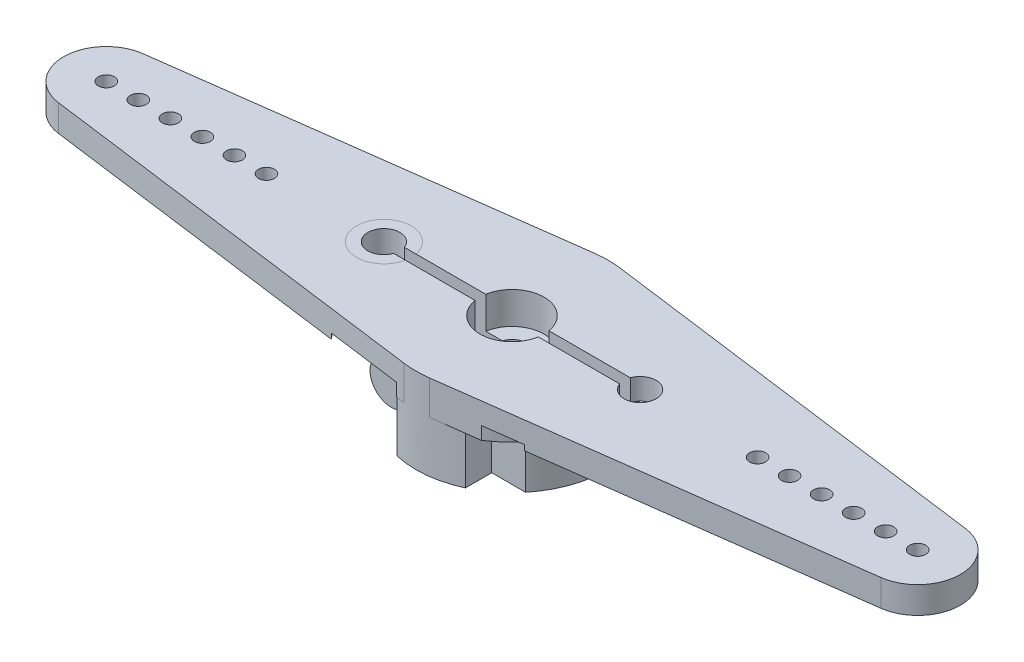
ISO-10303-21;
HEADER;
FILE_DESCRIPTION(('STEP AP214'),'2;1');
FILE_NAME('part.step','',(''),(''),'','','');
FILE_SCHEMA(('AUTOMOTIVE_DESIGN { 1 0 10303 214 1 1 1 1 }'));
ENDSEC;
DATA;
#1=APPLICATION_CONTEXT('core data for automotive mechanical design processes');
#2=APPLICATION_PROTOCOL_DEFINITION('international standard','automotive_design',2000,#1);
#3=PRODUCT_CONTEXT('',#1,'mechanical');
#4=PRODUCT('Part','Part','',(#3));
#5=PRODUCT_RELATED_PRODUCT_CATEGORY('part','',(#4));
#6=PRODUCT_DEFINITION_FORMATION('','',#4);
#7=PRODUCT_DEFINITION_CONTEXT('part definition',#1,'design');
#8=PRODUCT_DEFINITION('design','',#6,#7);
#9=PRODUCT_DEFINITION_SHAPE('','',#8);
#10=(LENGTH_UNIT() NAMED_UNIT(*) SI_UNIT(.MILLI.,.METRE.));
#11=(NAMED_UNIT(*) PLANE_ANGLE_UNIT() SI_UNIT($,.RADIAN.));
#12=(NAMED_UNIT(*) SI_UNIT($,.STERADIAN.) SOLID_ANGLE_UNIT());
#13=UNCERTAINTY_MEASURE_WITH_UNIT(LENGTH_MEASURE(1.E-05),#10,'distance_accuracy_value','');
#14=(GEOMETRIC_REPRESENTATION_CONTEXT(3) GLOBAL_UNCERTAINTY_ASSIGNED_CONTEXT((#13)) GLOBAL_UNIT_ASSIGNED_CONTEXT((#10,
#11,#12)) REPRESENTATION_CONTEXT('',''));
#15=CARTESIAN_POINT('',(0.,0.,0.));
#16=DIRECTION('',(0.,0.,1.));
#17=DIRECTION('',(1.,0.,0.));
#18=AXIS2_PLACEMENT_3D('',#15,#16,#17);
#19=CARTESIAN_POINT('',(-38.,2.5,0.));
#20=DIRECTION('',(0.,1.,0.));
#21=DIRECTION('',(0.,0.,1.));
#22=AXIS2_PLACEMENT_3D('',#19,#20,#21);
#23=PLANE('',#22);
#24=CARTESIAN_POINT('',(38.,2.5,0.));
#25=DIRECTION('',(0.,1.,0.));
#26=DIRECTION('',(0.,0.,-1.));
#27=AXIS2_PLACEMENT_3D('',#24,#25,#26);
#28=CIRCLE('',#27,0.750000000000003);
#29=CARTESIAN_POINT('',(38.,2.5,-0.749999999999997));
#30=VERTEX_POINT('',#29);
#31=EDGE_CURVE('E829',#30,#30,#28,.T.);
#32=ORIENTED_EDGE('',*,*,#31,.F.);
#33=EDGE_LOOP('',(#32));
#34=FACE_BOUND('',#33,.T.);
#35=CARTESIAN_POINT('',(32.,2.5,0.));
#36=DIRECTION('',(0.,1.,0.));
#37=DIRECTION('',(0.,0.,-1.));
#38=AXIS2_PLACEMENT_3D('',#35,#36,#37);
#39=CIRCLE('',#38,0.749999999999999);
#40=CARTESIAN_POINT('',(32.,2.5,-0.749999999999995));
#41=VERTEX_POINT('',#40);
#42=EDGE_CURVE('E817',#41,#41,#39,.T.);
#43=ORIENTED_EDGE('',*,*,#42,.F.);
#44=EDGE_LOOP('',(#43));
#45=FACE_BOUND('',#44,.T.);
#46=CARTESIAN_POINT('',(26.,2.5,0.));
#47=DIRECTION('',(0.,1.,0.));
#48=DIRECTION('',(0.,0.,-1.));
#49=AXIS2_PLACEMENT_3D('',#46,#47,#48);
#50=CIRCLE('',#49,0.750000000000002);
#51=CARTESIAN_POINT('',(26.,2.5,-0.749999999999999));
#52=VERTEX_POINT('',#51);
#53=EDGE_CURVE('E805',#52,#52,#50,.T.);
#54=ORIENTED_EDGE('',*,*,#53,.F.);
#55=EDGE_LOOP('',(#54));
#56=FACE_BOUND('',#55,.T.);
#57=CARTESIAN_POINT('',(-23.,2.5,0.));
#58=DIRECTION('',(0.,1.,0.));
#59=DIRECTION('',(0.,0.,1.));
#60=AXIS2_PLACEMENT_3D('',#57,#58,#59);
#61=CIRCLE('',#60,0.750000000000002);
#62=CARTESIAN_POINT('',(-23.,2.5,0.750000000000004));
#63=VERTEX_POINT('',#62);
#64=EDGE_CURVE('E793',#63,#63,#61,.T.);
#65=ORIENTED_EDGE('',*,*,#64,.F.);
#66=EDGE_LOOP('',(#65));
#67=FACE_BOUND('',#66,.T.);
#68=CARTESIAN_POINT('',(-29.,2.5,0.));
#69=DIRECTION('',(0.,1.,0.));
#70=DIRECTION('',(0.,0.,1.));
#71=AXIS2_PLACEMENT_3D('',#68,#69,#70);
#72=CIRCLE('',#71,0.750000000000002);
#73=CARTESIAN_POINT('',(-29.,2.5,0.750000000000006));
#74=VERTEX_POINT('',#73);
#75=EDGE_CURVE('E781',#74,#74,#72,.T.);
#76=ORIENTED_EDGE('',*,*,#75,.F.);
#77=EDGE_LOOP('',(#76));
#78=FACE_BOUND('',#77,.T.);
#79=CARTESIAN_POINT('',(-35.,2.5,0.));
#80=DIRECTION('',(0.,1.,0.));
#81=DIRECTION('',(0.,0.,1.));
#82=AXIS2_PLACEMENT_3D('',#79,#80,#81);
#83=CIRCLE('',#82,0.749999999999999);
#84=CARTESIAN_POINT('',(-35.,2.5,0.750000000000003));
#85=VERTEX_POINT('',#84);
#86=EDGE_CURVE('E770',#85,#85,#83,.T.);
#87=ORIENTED_EDGE('',*,*,#86,.F.);
#88=EDGE_LOOP('',(#87));
#89=FACE_BOUND('',#88,.T.);
#90=CARTESIAN_POINT('',(-38.,2.5,0.));
#91=DIRECTION('',(0.,1.,0.));
#92=DIRECTION('',(0.,0.,1.));
#93=AXIS2_PLACEMENT_3D('',#90,#91,#92);
#94=CIRCLE('',#93,4.);
#95=CARTESIAN_POINT('',(-38.5263157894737,2.5,-3.96522277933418));
#96=VERTEX_POINT('',#95);
#97=CARTESIAN_POINT('',(-38.5263157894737,2.5,3.96522277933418));
#98=VERTEX_POINT('',#97);
#99=EDGE_CURVE('E766',#96,#98,#94,.T.);
#100=ORIENTED_EDGE('',*,*,#99,.T.);
#101=DIRECTION('',(0.991305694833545,0.,0.131578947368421));
#102=VECTOR('',#101,1.);
#103=CARTESIAN_POINT('',(-1.18421052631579,2.5,8.92175125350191));
#104=LINE('',#103,#102);
#105=CARTESIAN_POINT('',(-1.18421052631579,2.5,8.92175125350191));
#106=VERTEX_POINT('',#105);
#107=EDGE_CURVE('E764',#98,#106,#104,.T.);
#108=ORIENTED_EDGE('',*,*,#107,.T.);
#109=CARTESIAN_POINT('',(0.,2.5,0.));
#110=DIRECTION('',(0.,1.,0.));
#111=DIRECTION('',(0.,0.,1.));
#112=AXIS2_PLACEMENT_3D('',#109,#110,#111);
#113=CIRCLE('',#112,9.);
#114=CARTESIAN_POINT('',(1.18421052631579,2.5,8.92175125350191));
#115=VERTEX_POINT('',#114);
#116=EDGE_CURVE('E762',#106,#115,#113,.T.);
#117=ORIENTED_EDGE('',*,*,#116,.T.);
#118=DIRECTION('',(0.991305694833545,0.,-0.131578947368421));
#119=VECTOR('',#118,1.);
#120=CARTESIAN_POINT('',(38.5263157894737,2.5,3.96522277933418));
#121=LINE('',#120,#119);
#122=CARTESIAN_POINT('',(38.5263157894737,2.5,3.96522277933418));
#123=VERTEX_POINT('',#122);
#124=EDGE_CURVE('E760',#115,#123,#121,.T.);
#125=ORIENTED_EDGE('',*,*,#124,.T.);
#126=CARTESIAN_POINT('',(38.,2.5,0.));
#127=DIRECTION('',(0.,1.,0.));
#128=DIRECTION('',(0.,0.,1.));
#129=AXIS2_PLACEMENT_3D('',#126,#127,#128);
#130=CIRCLE('',#129,4.);
#131=CARTESIAN_POINT('',(38.5263157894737,2.5,-3.96522277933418));
#132=VERTEX_POINT('',#131);
#133=EDGE_CURVE('E758',#123,#132,#130,.T.);
#134=ORIENTED_EDGE('',*,*,#133,.T.);
#135=DIRECTION('',(-0.991305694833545,0.,-0.131578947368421));
#136=VECTOR('',#135,1.);
#137=CARTESIAN_POINT('',(1.18421052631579,2.5,-8.92175125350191));
#138=LINE('',#137,#136);
#139=CARTESIAN_POINT('',(1.18421052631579,2.5,-8.92175125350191));
#140=VERTEX_POINT('',#139);
#141=EDGE_CURVE('E756',#132,#140,#138,.T.);
#142=ORIENTED_EDGE('',*,*,#141,.T.);
#143=CARTESIAN_POINT('',(0.,2.5,0.));
#144=DIRECTION('',(0.,1.,0.));
#145=DIRECTION('',(0.,0.,1.));
#146=AXIS2_PLACEMENT_3D('',#143,#144,#145);
#147=CIRCLE('',#146,9.);
#148=CARTESIAN_POINT('',(-1.18421052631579,2.5,-8.92175125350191));
#149=VERTEX_POINT('',#148);
#150=EDGE_CURVE('E754',#140,#149,#147,.T.);
#151=ORIENTED_EDGE('',*,*,#150,.T.);
#152=DIRECTION('',(-0.991305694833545,0.,0.131578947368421));
#153=VECTOR('',#152,1.);
#154=CARTESIAN_POINT('',(-38.5263157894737,2.5,-3.96522277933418));
#155=LINE('',#154,#153);
#156=EDGE_CURVE('E752',#149,#96,#155,.T.);
#157=ORIENTED_EDGE('',*,*,#156,.T.);
#158=EDGE_LOOP('',(#100,#108,#117,#125,#134,#142,#151,#157));
#159=FACE_BOUND('',#158,.T.);
#160=CARTESIAN_POINT('',(-38.,2.5,0.));
#161=DIRECTION('',(0.,1.,0.));
#162=DIRECTION('',(0.,0.,1.));
#163=AXIS2_PLACEMENT_3D('',#160,#161,#162);
#164=CIRCLE('',#163,0.749999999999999);
#165=CARTESIAN_POINT('',(-38.,2.5,0.749999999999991));
#166=VERTEX_POINT('',#165);
#167=EDGE_CURVE('E747',#166,#166,#164,.T.);
#168=ORIENTED_EDGE('',*,*,#167,.F.);
#169=EDGE_LOOP('',(#168));
#170=FACE_BOUND('',#169,.T.);
#171=CARTESIAN_POINT('',(-32.,2.5,0.));
#172=DIRECTION('',(0.,1.,0.));
#173=DIRECTION('',(0.,0.,1.));
#174=AXIS2_PLACEMENT_3D('',#171,#172,#173);
#175=CIRCLE('',#174,0.749999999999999);
#176=CARTESIAN_POINT('',(-32.,2.5,0.750000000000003));
#177=VERTEX_POINT('',#176);
#178=EDGE_CURVE('E775',#177,#177,#175,.T.);
#179=ORIENTED_EDGE('',*,*,#178,.F.);
#180=EDGE_LOOP('',(#179));
#181=FACE_BOUND('',#180,.T.);
#182=CARTESIAN_POINT('',(-26.,2.5,0.));
#183=DIRECTION('',(0.,1.,0.));
#184=DIRECTION('',(0.,0.,1.));
#185=AXIS2_PLACEMENT_3D('',#182,#183,#184);
#186=CIRCLE('',#185,0.750000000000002);
#187=CARTESIAN_POINT('',(-26.,2.5,0.750000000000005));
#188=VERTEX_POINT('',#187);
#189=EDGE_CURVE('E787',#188,#188,#186,.T.);
#190=ORIENTED_EDGE('',*,*,#189,.F.);
#191=EDGE_LOOP('',(#190));
#192=FACE_BOUND('',#191,.T.);
#193=CARTESIAN_POINT('',(23.,2.5,0.));
#194=DIRECTION('',(0.,1.,0.));
#195=DIRECTION('',(0.,0.,-1.));
#196=AXIS2_PLACEMENT_3D('',#193,#194,#195);
#197=CIRCLE('',#196,0.750000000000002);
#198=CARTESIAN_POINT('',(23.,2.5,-0.75));
#199=VERTEX_POINT('',#198);
#200=EDGE_CURVE('E799',#199,#199,#197,.T.);
#201=ORIENTED_EDGE('',*,*,#200,.F.);
#202=EDGE_LOOP('',(#201));
#203=FACE_BOUND('',#202,.T.);
#204=CARTESIAN_POINT('',(29.,2.5,0.));
#205=DIRECTION('',(0.,1.,0.));
#206=DIRECTION('',(0.,0.,-1.));
#207=AXIS2_PLACEMENT_3D('',#204,#205,#206);
#208=CIRCLE('',#207,0.750000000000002);
#209=CARTESIAN_POINT('',(29.,2.5,-0.749999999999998));
#210=VERTEX_POINT('',#209);
#211=EDGE_CURVE('E811',#210,#210,#208,.T.);
#212=ORIENTED_EDGE('',*,*,#211,.F.);
#213=EDGE_LOOP('',(#212));
#214=FACE_BOUND('',#213,.T.);
#215=CARTESIAN_POINT('',(35.,2.5,0.));
#216=DIRECTION('',(0.,1.,0.));
#217=DIRECTION('',(0.,0.,-1.));
#218=AXIS2_PLACEMENT_3D('',#215,#216,#217);
#219=CIRCLE('',#218,0.749999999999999);
#220=CARTESIAN_POINT('',(35.,2.5,-0.749999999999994));
#221=VERTEX_POINT('',#220);
#222=EDGE_CURVE('E823',#221,#221,#219,.T.);
#223=ORIENTED_EDGE('',*,*,#222,.F.);
#224=EDGE_LOOP('',(#223));
#225=FACE_BOUND('',#224,.T.);
#226=DIRECTION('',(1.,0.,0.));
#227=VECTOR('',#226,1.);
#228=CARTESIAN_POINT('',(-10.5857864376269,2.5,0.5));
#229=LINE('',#228,#227);
#230=CARTESIAN_POINT('',(-9.49232697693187,2.5,0.5));
#231=VERTEX_POINT('',#230);
#232=CARTESIAN_POINT('',(-2.95803989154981,2.5,0.499999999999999));
#233=VERTEX_POINT('',#232);
#234=EDGE_CURVE('E1152',#231,#233,#229,.T.);
#235=ORIENTED_EDGE('',*,*,#234,.F.);
#236=CARTESIAN_POINT('',(-12.,2.5,0.));
#237=DIRECTION('',(0.,1.,0.));
#238=DIRECTION('',(0.,0.,1.));
#239=AXIS2_PLACEMENT_3D('',#236,#237,#238);
#240=CIRCLE('',#239,2.55703421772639);
#241=CARTESIAN_POINT('',(-9.49232697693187,2.5,-0.5));
#242=VERTEX_POINT('',#241);
#243=EDGE_CURVE('E11',#231,#242,#240,.F.);
#244=ORIENTED_EDGE('',*,*,#243,.T.);
#245=DIRECTION('',(-1.,0.,0.));
#246=VECTOR('',#245,1.);
#247=CARTESIAN_POINT('',(-10.5857864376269,2.5,-0.5));
#248=LINE('',#247,#246);
#249=CARTESIAN_POINT('',(-2.95803989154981,2.5,-0.500000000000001));
#250=VERTEX_POINT('',#249);
#251=EDGE_CURVE('E1159',#250,#242,#248,.T.);
#252=ORIENTED_EDGE('',*,*,#251,.F.);
#253=CARTESIAN_POINT('',(0.,2.5,0.));
#254=DIRECTION('',(0.,1.,0.));
#255=DIRECTION('',(0.,0.,1.));
#256=AXIS2_PLACEMENT_3D('',#253,#254,#255);
#257=CIRCLE('',#256,3.);
#258=CARTESIAN_POINT('',(2.95803989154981,2.5,-0.500000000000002));
#259=VERTEX_POINT('',#258);
#260=EDGE_CURVE('E1129',#259,#250,#257,.T.);
#261=ORIENTED_EDGE('',*,*,#260,.F.);
#262=CARTESIAN_POINT('',(10.5857864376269,2.5,-0.500000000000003));
#263=VERTEX_POINT('',#262);
#264=EDGE_CURVE('E1156',#263,#259,#248,.T.);
#265=ORIENTED_EDGE('',*,*,#264,.F.);
#266=CARTESIAN_POINT('',(12.,2.5,0.));
#267=DIRECTION('',(0.,1.,0.));
#268=DIRECTION('',(0.,0.,1.));
#269=AXIS2_PLACEMENT_3D('',#266,#267,#268);
#270=CIRCLE('',#269,1.5);
#271=CARTESIAN_POINT('',(10.5857864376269,2.5,0.499999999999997));
#272=VERTEX_POINT('',#271);
#273=EDGE_CURVE('E1151',#272,#263,#270,.T.);
#274=ORIENTED_EDGE('',*,*,#273,.F.);
#275=CARTESIAN_POINT('',(2.95803989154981,2.5,0.499999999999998));
#276=VERTEX_POINT('',#275);
#277=EDGE_CURVE('E1147',#276,#272,#229,.T.);
#278=ORIENTED_EDGE('',*,*,#277,.F.);
#279=EDGE_CURVE('E1125',#233,#276,#257,.T.);
#280=ORIENTED_EDGE('',*,*,#279,.F.);
#281=EDGE_LOOP('',(#235,#244,#252,#261,#265,#274,#278,#280));
#282=FACE_BOUND('',#281,.T.);
#283=ADVANCED_FACE('F40',(#34,#45,#56,#67,#78,#89,#159,#170,#181,#192,#203,#214,#225,#282),#23,.T.);
#284=CARTESIAN_POINT('',(2.,7.21685201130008,-3.8));
#285=DIRECTION('',(0.,0.,1.));
#286=DIRECTION('',(1.,0.,0.));
#287=AXIS2_PLACEMENT_3D('',#284,#285,#286);
#288=PLANE('',#287);
#289=DIRECTION('',(0.,-1.,0.));
#290=VECTOR('',#289,1.);
#291=CARTESIAN_POINT('',(2.,7.21685201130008,-3.8));
#292=LINE('',#291,#290);
#293=CARTESIAN_POINT('',(2.,0.5,-3.8));
#294=VERTEX_POINT('',#293);
#295=CARTESIAN_POINT('',(2.,-5.5,-3.8));
#296=VERTEX_POINT('',#295);
#297=EDGE_CURVE('E1198',#294,#296,#292,.T.);
#298=ORIENTED_EDGE('',*,*,#297,.F.);
#299=DIRECTION('',(1.,0.,0.));
#300=VECTOR('',#299,1.);
#301=CARTESIAN_POINT('',(9.24986486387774,0.5,-3.8));
#302=LINE('',#301,#300);
#303=CARTESIAN_POINT('',(9.24986486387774,0.5,-3.8));
#304=VERTEX_POINT('',#303);
#305=EDGE_CURVE('E1183',#294,#304,#302,.T.);
#306=ORIENTED_EDGE('',*,*,#305,.T.);
#307=DIRECTION('',(0.,-1.,0.));
#308=VECTOR('',#307,1.);
#309=CARTESIAN_POINT('',(9.24986486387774,9.31450015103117,-3.8));
#310=LINE('',#309,#308);
#311=CARTESIAN_POINT('',(9.24986486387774,-0.7,-3.8));
#312=VERTEX_POINT('',#311);
#313=EDGE_CURVE('E1186',#304,#312,#310,.T.);
#314=ORIENTED_EDGE('',*,*,#313,.T.);
#315=DIRECTION('',(-1.,0.,0.));
#316=VECTOR('',#315,1.);
#317=CARTESIAN_POINT('',(9.24986486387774,-0.7,-3.8));
#318=LINE('',#317,#316);
#319=CARTESIAN_POINT('',(8.15843122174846,-0.7,-3.8));
#320=VERTEX_POINT('',#319);
#321=EDGE_CURVE('E1176',#312,#320,#318,.T.);
#322=ORIENTED_EDGE('',*,*,#321,.T.);
#323=DIRECTION('',(0.,-1.,0.));
#324=VECTOR('',#323,1.);
#325=CARTESIAN_POINT('',(8.15843122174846,7.21685201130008,-3.8));
#326=LINE('',#325,#324);
#327=CARTESIAN_POINT('',(8.15843122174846,-5.5,-3.8));
#328=VERTEX_POINT('',#327);
#329=EDGE_CURVE('E1199',#320,#328,#326,.T.);
#330=ORIENTED_EDGE('',*,*,#329,.T.);
#331=DIRECTION('',(-1.,0.,0.));
#332=VECTOR('',#331,1.);
#333=CARTESIAN_POINT('',(2.,-5.5,-3.8));
#334=LINE('',#333,#332);
#335=EDGE_CURVE('E1188',#328,#296,#334,.T.);
#336=ORIENTED_EDGE('',*,*,#335,.T.);
#337=EDGE_LOOP('',(#298,#306,#314,#322,#330,#336));
#338=FACE_BOUND('',#337,.T.);
#339=CARTESIAN_POINT('',(5.,-2.3,-3.8));
#340=DIRECTION('',(0.,0.,1.));
#341=DIRECTION('',(1.,0.,0.));
#342=AXIS2_PLACEMENT_3D('',#339,#340,#341);
#343=CIRCLE('',#342,2.);
#344=CARTESIAN_POINT('',(7.,-2.3,-3.8));
#345=VERTEX_POINT('',#344);
#346=EDGE_CURVE('E49',#345,#345,#343,.F.);
#347=ORIENTED_EDGE('',*,*,#346,.F.);
#348=EDGE_LOOP('',(#347));
#349=FACE_BOUND('',#348,.T.);
#350=ADVANCED_FACE('F535',(#338,#349),#288,.F.);
#351=CARTESIAN_POINT('',(-8.15843122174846,7.21685201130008,3.8));
#352=DIRECTION('',(0.,0.,-1.));
#353=DIRECTION('',(-1.,0.,0.));
#354=AXIS2_PLACEMENT_3D('',#351,#352,#353);
#355=PLANE('',#354);
#356=DIRECTION('',(0.,-1.,0.));
#357=VECTOR('',#356,1.);
#358=CARTESIAN_POINT('',(-2.,7.21685201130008,3.8));
#359=LINE('',#358,#357);
#360=CARTESIAN_POINT('',(-2.,0.5,3.8));
#361=VERTEX_POINT('',#360);
#362=CARTESIAN_POINT('',(-2.,-5.5,3.8));
#363=VERTEX_POINT('',#362);
#364=EDGE_CURVE('E1084',#361,#363,#359,.T.);
#365=ORIENTED_EDGE('',*,*,#364,.F.);
#366=DIRECTION('',(-1.,0.,0.));
#367=VECTOR('',#366,1.);
#368=CARTESIAN_POINT('',(-9.24986486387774,0.5,3.8));
#369=LINE('',#368,#367);
#370=CARTESIAN_POINT('',(-9.24986486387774,0.5,3.8));
#371=VERTEX_POINT('',#370);
#372=EDGE_CURVE('E1173',#361,#371,#369,.T.);
#373=ORIENTED_EDGE('',*,*,#372,.T.);
#374=DIRECTION('',(0.,-1.,0.));
#375=VECTOR('',#374,1.);
#376=CARTESIAN_POINT('',(-9.24986486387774,9.31450015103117,3.8));
#377=LINE('',#376,#375);
#378=CARTESIAN_POINT('',(-9.24986486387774,-0.7,3.8));
#379=VERTEX_POINT('',#378);
#380=EDGE_CURVE('E432',#371,#379,#377,.T.);
#381=ORIENTED_EDGE('',*,*,#380,.T.);
#382=DIRECTION('',(1.,0.,0.));
#383=VECTOR('',#382,1.);
#384=CARTESIAN_POINT('',(-9.24986486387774,-0.7,3.8));
#385=LINE('',#384,#383);
#386=CARTESIAN_POINT('',(-8.15843122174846,-0.699999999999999,3.8));
#387=VERTEX_POINT('',#386);
#388=EDGE_CURVE('E420',#379,#387,#385,.T.);
#389=ORIENTED_EDGE('',*,*,#388,.T.);
#390=DIRECTION('',(0.,-1.,0.));
#391=VECTOR('',#390,1.);
#392=CARTESIAN_POINT('',(-8.15843122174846,7.21685201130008,3.8));
#393=LINE('',#392,#391);
#394=CARTESIAN_POINT('',(-8.15843122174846,-5.5,3.8));
#395=VERTEX_POINT('',#394);
#396=EDGE_CURVE('E1081',#387,#395,#393,.T.);
#397=ORIENTED_EDGE('',*,*,#396,.T.);
#398=DIRECTION('',(1.,0.,0.));
#399=VECTOR('',#398,1.);
#400=CARTESIAN_POINT('',(-8.15843122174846,-5.5,3.8));
#401=LINE('',#400,#399);
#402=EDGE_CURVE('E869',#395,#363,#401,.T.);
#403=ORIENTED_EDGE('',*,*,#402,.T.);
#404=EDGE_LOOP('',(#365,#373,#381,#389,#397,#403));
#405=FACE_BOUND('',#404,.T.);
#406=CARTESIAN_POINT('',(-5.,-2.3,3.8));
#407=DIRECTION('',(0.,0.,-1.));
#408=DIRECTION('',(-1.,0.,0.));
#409=AXIS2_PLACEMENT_3D('',#406,#407,#408);
#410=CIRCLE('',#409,2.);
#411=CARTESIAN_POINT('',(-7.,-2.3,3.8));
#412=VERTEX_POINT('',#411);
#413=EDGE_CURVE('E527',#412,#412,#410,.F.);
#414=ORIENTED_EDGE('',*,*,#413,.F.);
#415=EDGE_LOOP('',(#414));
#416=FACE_BOUND('',#415,.T.);
#417=ADVANCED_FACE('F537',(#405,#416),#355,.F.);
#418=CARTESIAN_POINT('',(0.,-0.7,0.));
#419=DIRECTION('',(0.,-1.,0.));
#420=DIRECTION('',(0.,0.,-1.));
#421=AXIS2_PLACEMENT_3D('',#418,#419,#420);
#422=PLANE('',#421);
#423=DIRECTION('',(0.,0.,1.));
#424=VECTOR('',#423,1.);
#425=CARTESIAN_POINT('',(-2.,-0.7,3.8));
#426=LINE('',#425,#424);
#427=CARTESIAN_POINT('',(-2.,-0.7,8.77496438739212));
#428=VERTEX_POINT('',#427);
#429=CARTESIAN_POINT('',(-2.,-0.7,8.81346909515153));
#430=VERTEX_POINT('',#429);
#431=EDGE_CURVE('E409',#428,#430,#426,.T.);
#432=ORIENTED_EDGE('',*,*,#431,.F.);
#433=CARTESIAN_POINT('',(0.,-0.7,0.));
#434=DIRECTION('',(0.,-1.,0.));
#435=DIRECTION('',(0.,0.,-1.));
#436=AXIS2_PLACEMENT_3D('',#433,#434,#435);
#437=CIRCLE('',#436,9.);
#438=CARTESIAN_POINT('',(-1.18421052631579,-0.7,8.92175125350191));
#439=VERTEX_POINT('',#438);
#440=EDGE_CURVE('E435',#439,#428,#437,.T.);
#441=ORIENTED_EDGE('',*,*,#440,.F.);
#442=DIRECTION('',(-0.991305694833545,0.,-0.131578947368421));
#443=VECTOR('',#442,1.);
#444=CARTESIAN_POINT('',(-5.50521187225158,-0.7,8.34821191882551));
#445=LINE('',#444,#443);
#446=EDGE_CURVE('E427',#439,#430,#445,.T.);
#447=ORIENTED_EDGE('',*,*,#446,.T.);
#448=EDGE_LOOP('',(#432,#441,#447));
#449=FACE_BOUND('',#448,.T.);
#450=ADVANCED_FACE('F434',(#449),#422,.T.);
#451=DIRECTION('',(0.,0.,-1.));
#452=VECTOR('',#451,1.);
#453=CARTESIAN_POINT('',(2.,-0.7,-3.8));
#454=LINE('',#453,#452);
#455=CARTESIAN_POINT('',(2.,-0.7,-8.77496438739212));
#456=VERTEX_POINT('',#455);
#457=CARTESIAN_POINT('',(2.,-0.7,-8.81346909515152));
#458=VERTEX_POINT('',#457);
#459=EDGE_CURVE('E1174',#456,#458,#454,.T.);
#460=ORIENTED_EDGE('',*,*,#459,.F.);
#461=CARTESIAN_POINT('',(1.18421052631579,-0.7,-8.92175125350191));
#462=VERTEX_POINT('',#461);
#463=EDGE_CURVE('E500',#462,#456,#437,.T.);
#464=ORIENTED_EDGE('',*,*,#463,.F.);
#465=DIRECTION('',(0.991305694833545,0.,0.131578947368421));
#466=VECTOR('',#465,1.);
#467=CARTESIAN_POINT('',(5.50521187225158,-0.7,-8.34821191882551));
#468=LINE('',#467,#466);
#469=EDGE_CURVE('E495',#462,#458,#468,.T.);
#470=ORIENTED_EDGE('',*,*,#469,.T.);
#471=EDGE_LOOP('',(#460,#464,#470));
#472=FACE_BOUND('',#471,.T.);
#473=ADVANCED_FACE('F1228',(#472),#422,.T.);
#474=CARTESIAN_POINT('',(0.,2.5,0.));
#475=DIRECTION('',(0.,-1.,0.));
#476=DIRECTION('',(0.,0.,-1.));
#477=AXIS2_PLACEMENT_3D('',#474,#475,#476);
#478=CYLINDRICAL_SURFACE('',#477,9.);
#479=CARTESIAN_POINT('',(0.,-5.5,0.));
#480=DIRECTION('',(0.,-1.,0.));
#481=DIRECTION('',(0.,0.,-1.));
#482=AXIS2_PLACEMENT_3D('',#479,#480,#481);
#483=CIRCLE('',#482,9.);
#484=CARTESIAN_POINT('',(8.98610037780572,-5.5,-0.500000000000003));
#485=VERTEX_POINT('',#484);
#486=EDGE_CURVE('E860',#328,#485,#483,.T.);
#487=ORIENTED_EDGE('',*,*,#486,.F.);
#488=ORIENTED_EDGE('',*,*,#329,.F.);
#489=CARTESIAN_POINT('',(8.98610037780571,-0.7,-0.500000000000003));
#490=VERTEX_POINT('',#489);
#491=EDGE_CURVE('E525',#320,#490,#437,.T.);
#492=ORIENTED_EDGE('',*,*,#491,.T.);
#493=DIRECTION('',(0.,-1.,0.));
#494=VECTOR('',#493,1.);
#495=CARTESIAN_POINT('',(8.98610037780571,2.5,-0.500000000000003));
#496=LINE('',#495,#494);
#497=EDGE_CURVE('E913',#490,#485,#496,.T.);
#498=ORIENTED_EDGE('',*,*,#497,.T.);
#499=EDGE_LOOP('',(#487,#488,#492,#498));
#500=FACE_BOUND('',#499,.T.);
#501=ADVANCED_FACE('F718',(#500),#478,.T.);
#502=CARTESIAN_POINT('',(-8.98610037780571,-0.7,-0.5));
#503=VERTEX_POINT('',#502);
#504=CARTESIAN_POINT('',(-6.96491205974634,-0.699999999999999,-5.7));
#505=VERTEX_POINT('',#504);
#506=EDGE_CURVE('E511',#503,#505,#437,.T.);
#507=ORIENTED_EDGE('',*,*,#506,.T.);
#508=DIRECTION('',(0.,-1.,0.));
#509=VECTOR('',#508,1.);
#510=CARTESIAN_POINT('',(-6.96491205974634,7.21685201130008,-5.7));
#511=LINE('',#510,#509);
#512=CARTESIAN_POINT('',(-6.96491205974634,-5.5,-5.7));
#513=VERTEX_POINT('',#512);
#514=EDGE_CURVE('E1042',#505,#513,#511,.T.);
#515=ORIENTED_EDGE('',*,*,#514,.T.);
#516=CARTESIAN_POINT('',(-8.98610037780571,-5.5,-0.5));
#517=VERTEX_POINT('',#516);
#518=EDGE_CURVE('E853',#517,#513,#483,.T.);
#519=ORIENTED_EDGE('',*,*,#518,.F.);
#520=DIRECTION('',(0.,-1.,0.));
#521=VECTOR('',#520,1.);
#522=CARTESIAN_POINT('',(-8.98610037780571,2.5,-0.5));
#523=LINE('',#522,#521);
#524=EDGE_CURVE('E902',#517,#503,#523,.F.);
#525=ORIENTED_EDGE('',*,*,#524,.T.);
#526=EDGE_LOOP('',(#507,#515,#519,#525));
#527=FACE_BOUND('',#526,.T.);
#528=ADVANCED_FACE('F1039',(#527),#478,.T.);
#529=CARTESIAN_POINT('',(8.98610037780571,-0.7,0.499999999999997));
#530=VERTEX_POINT('',#529);
#531=CARTESIAN_POINT('',(6.96491205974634,-0.699999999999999,5.7));
#532=VERTEX_POINT('',#531);
#533=EDGE_CURVE('E515',#530,#532,#437,.T.);
#534=ORIENTED_EDGE('',*,*,#533,.T.);
#535=DIRECTION('',(0.,-1.,0.));
#536=VECTOR('',#535,1.);
#537=CARTESIAN_POINT('',(6.96491205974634,7.21685201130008,5.7));
#538=LINE('',#537,#536);
#539=CARTESIAN_POINT('',(6.96491205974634,-5.5,5.7));
#540=VERTEX_POINT('',#539);
#541=EDGE_CURVE('E1066',#532,#540,#538,.T.);
#542=ORIENTED_EDGE('',*,*,#541,.T.);
#543=CARTESIAN_POINT('',(8.98610037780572,-5.5,0.499999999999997));
#544=VERTEX_POINT('',#543);
#545=EDGE_CURVE('E846',#544,#540,#483,.T.);
#546=ORIENTED_EDGE('',*,*,#545,.F.);
#547=DIRECTION('',(0.,-1.,0.));
#548=VECTOR('',#547,1.);
#549=CARTESIAN_POINT('',(8.98610037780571,2.5,0.499999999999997));
#550=LINE('',#549,#548);
#551=EDGE_CURVE('E894',#544,#530,#550,.F.);
#552=ORIENTED_EDGE('',*,*,#551,.T.);
#553=EDGE_LOOP('',(#534,#542,#546,#552));
#554=FACE_BOUND('',#553,.T.);
#555=ADVANCED_FACE('F1521',(#554),#478,.T.);
#556=CARTESIAN_POINT('',(3.8,-5.5,8.15843122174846));
#557=VERTEX_POINT('',#556);
#558=CARTESIAN_POINT('',(-2.,-5.5,8.77496438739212));
#559=VERTEX_POINT('',#558);
#560=EDGE_CURVE('E852',#557,#559,#483,.T.);
#561=ORIENTED_EDGE('',*,*,#560,.F.);
#562=DIRECTION('',(0.,-1.,0.));
#563=VECTOR('',#562,1.);
#564=CARTESIAN_POINT('',(3.8,7.21685201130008,8.15843122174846));
#565=LINE('',#564,#563);
#566=CARTESIAN_POINT('',(3.8,-0.699999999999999,8.15843122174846));
#567=VERTEX_POINT('',#566);
#568=EDGE_CURVE('E1071',#567,#557,#565,.T.);
#569=ORIENTED_EDGE('',*,*,#568,.F.);
#570=CARTESIAN_POINT('',(1.18421052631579,-0.7,8.92175125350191));
#571=VERTEX_POINT('',#570);
#572=EDGE_CURVE('E522',#567,#571,#437,.T.);
#573=ORIENTED_EDGE('',*,*,#572,.T.);
#574=DIRECTION('',(0.,-1.,0.));
#575=VECTOR('',#574,1.);
#576=CARTESIAN_POINT('',(1.18421052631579,2.5,8.92175125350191));
#577=LINE('',#576,#575);
#578=EDGE_CURVE('E451',#115,#571,#577,.T.);
#579=ORIENTED_EDGE('',*,*,#578,.F.);
#580=ORIENTED_EDGE('',*,*,#116,.F.);
#581=DIRECTION('',(0.,-1.,0.));
#582=VECTOR('',#581,1.);
#583=CARTESIAN_POINT('',(-1.18421052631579,2.5,8.92175125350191));
#584=LINE('',#583,#582);
#585=EDGE_CURVE('E454',#106,#439,#584,.T.);
#586=ORIENTED_EDGE('',*,*,#585,.T.);
#587=ORIENTED_EDGE('',*,*,#440,.T.);
#588=DIRECTION('',(0.,-1.,0.));
#589=VECTOR('',#588,1.);
#590=CARTESIAN_POINT('',(-2.,7.21685201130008,8.77496438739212));
#591=LINE('',#590,#589);
#592=EDGE_CURVE('E416',#428,#559,#591,.T.);
#593=ORIENTED_EDGE('',*,*,#592,.T.);
#594=EDGE_LOOP('',(#561,#569,#573,#579,#580,#586,#587,#593));
#595=FACE_BOUND('',#594,.T.);
#596=ADVANCED_FACE('F585',(#595),#478,.T.);
#597=CARTESIAN_POINT('',(0.,-5.5,0.));
#598=DIRECTION('',(0.,1.,0.));
#599=DIRECTION('',(0.,0.,1.));
#600=AXIS2_PLACEMENT_3D('',#597,#598,#599);
#601=CYLINDRICAL_SURFACE('',#600,1.5);
#602=CARTESIAN_POINT('',(0.,-2.,0.));
#603=DIRECTION('',(0.,-1.,0.));
#604=DIRECTION('',(0.,0.,-1.));
#605=AXIS2_PLACEMENT_3D('',#602,#603,#604);
#606=CIRCLE('',#605,1.5);
#607=CARTESIAN_POINT('',(1.41421356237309,-2.,-0.500000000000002));
#608=VERTEX_POINT('',#607);
#609=CARTESIAN_POINT('',(-1.41421356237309,-2.,-0.500000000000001));
#610=VERTEX_POINT('',#609);
#611=EDGE_CURVE('E1097',#608,#610,#606,.F.);
#612=ORIENTED_EDGE('',*,*,#611,.F.);
#613=DIRECTION('',(0.,1.,0.));
#614=VECTOR('',#613,1.);
#615=CARTESIAN_POINT('',(1.41421356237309,-5.5,-0.500000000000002));
#616=LINE('',#615,#614);
#617=CARTESIAN_POINT('',(1.41421356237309,-0.5,-0.500000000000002));
#618=VERTEX_POINT('',#617);
#619=EDGE_CURVE('E1120',#618,#608,#616,.F.);
#620=ORIENTED_EDGE('',*,*,#619,.F.);
#621=CARTESIAN_POINT('',(0.,-0.5,0.));
#622=DIRECTION('',(0.,1.,0.));
#623=DIRECTION('',(0.,0.,1.));
#624=AXIS2_PLACEMENT_3D('',#621,#622,#623);
#625=CIRCLE('',#624,1.5);
#626=CARTESIAN_POINT('',(-1.41421356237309,-0.5,-0.500000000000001));
#627=VERTEX_POINT('',#626);
#628=EDGE_CURVE('E1265',#618,#627,#625,.T.);
#629=ORIENTED_EDGE('',*,*,#628,.T.);
#630=DIRECTION('',(0.,1.,0.));
#631=VECTOR('',#630,1.);
#632=CARTESIAN_POINT('',(-1.41421356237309,-5.5,-0.500000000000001));
#633=LINE('',#632,#631);
#634=EDGE_CURVE('E1123',#610,#627,#633,.T.);
#635=ORIENTED_EDGE('',*,*,#634,.F.);
#636=EDGE_LOOP('',(#612,#620,#629,#635));
#637=FACE_BOUND('',#636,.T.);
#638=ADVANCED_FACE('F581',(#637),#601,.F.);
#639=CARTESIAN_POINT('',(0.,-2.,0.));
#640=DIRECTION('',(0.,-1.,0.));
#641=DIRECTION('',(0.,0.,-1.));
#642=AXIS2_PLACEMENT_3D('',#639,#640,#641);
#643=CIRCLE('',#642,1.5);
#644=CARTESIAN_POINT('',(-1.4142135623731,-2.,0.499999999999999));
#645=VERTEX_POINT('',#644);
#646=CARTESIAN_POINT('',(1.4142135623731,-2.,0.499999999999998));
#647=VERTEX_POINT('',#646);
#648=EDGE_CURVE('E1268',#645,#647,#643,.F.);
#649=ORIENTED_EDGE('',*,*,#648,.F.);
#650=DIRECTION('',(0.,1.,0.));
#651=VECTOR('',#650,1.);
#652=CARTESIAN_POINT('',(-1.4142135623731,-5.5,0.499999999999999));
#653=LINE('',#652,#651);
#654=CARTESIAN_POINT('',(-1.4142135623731,-0.5,0.499999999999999));
#655=VERTEX_POINT('',#654);
#656=EDGE_CURVE('E1115',#655,#645,#653,.F.);
#657=ORIENTED_EDGE('',*,*,#656,.F.);
#658=CARTESIAN_POINT('',(0.,-0.5,0.));
#659=DIRECTION('',(0.,1.,0.));
#660=DIRECTION('',(0.,0.,1.));
#661=AXIS2_PLACEMENT_3D('',#658,#659,#660);
#662=CIRCLE('',#661,1.5);
#663=CARTESIAN_POINT('',(1.4142135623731,-0.5,0.499999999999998));
#664=VERTEX_POINT('',#663);
#665=EDGE_CURVE('E1112',#655,#664,#662,.T.);
#666=ORIENTED_EDGE('',*,*,#665,.T.);
#667=DIRECTION('',(0.,1.,0.));
#668=VECTOR('',#667,1.);
#669=CARTESIAN_POINT('',(1.4142135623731,-5.5,0.499999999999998));
#670=LINE('',#669,#668);
#671=EDGE_CURVE('E1118',#647,#664,#670,.T.);
#672=ORIENTED_EDGE('',*,*,#671,.F.);
#673=EDGE_LOOP('',(#649,#657,#666,#672));
#674=FACE_BOUND('',#673,.T.);
#675=ADVANCED_FACE('F584',(#674),#601,.F.);
#676=CARTESIAN_POINT('',(-10.5857864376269,-5.5,-0.5));
#677=DIRECTION('',(0.,0.,-1.));
#678=DIRECTION('',(-1.,0.,0.));
#679=AXIS2_PLACEMENT_3D('',#676,#677,#678);
#680=PLANE('',#679);
#681=CARTESIAN_POINT('',(-5.,-2.3,-0.5));
#682=DIRECTION('',(0.,0.,-1.));
#683=DIRECTION('',(-1.,0.,0.));
#684=AXIS2_PLACEMENT_3D('',#681,#682,#683);
#685=CIRCLE('',#684,1.25);
#686=CARTESIAN_POINT('',(-6.25,-2.3,-0.5));
#687=VERTEX_POINT('',#686);
#688=EDGE_CURVE('E421',#687,#687,#685,.F.);
#689=ORIENTED_EDGE('',*,*,#688,.F.);
#690=EDGE_LOOP('',(#689));
#691=FACE_BOUND('',#690,.T.);
#692=DIRECTION('',(-1.,0.,0.));
#693=VECTOR('',#692,1.);
#694=CARTESIAN_POINT('',(-10.5857864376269,-5.5,-0.5));
#695=LINE('',#694,#693);
#696=CARTESIAN_POINT('',(-2.95803989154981,-5.5,-0.500000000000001));
#697=VERTEX_POINT('',#696);
#698=EDGE_CURVE('E877',#697,#517,#695,.T.);
#699=ORIENTED_EDGE('',*,*,#698,.F.);
#700=DIRECTION('',(0.,-1.,0.));
#701=VECTOR('',#700,1.);
#702=CARTESIAN_POINT('',(-2.95803989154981,-2.,-0.500000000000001));
#703=LINE('',#702,#701);
#704=CARTESIAN_POINT('',(-2.95803989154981,-2.,-0.500000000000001));
#705=VERTEX_POINT('',#704);
#706=EDGE_CURVE('E1109',#697,#705,#703,.F.);
#707=ORIENTED_EDGE('',*,*,#706,.T.);
#708=DIRECTION('',(-1.,0.,0.));
#709=VECTOR('',#708,1.);
#710=CARTESIAN_POINT('',(-10.5857864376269,-2.,-0.5));
#711=LINE('',#710,#709);
#712=EDGE_CURVE('E1101',#610,#705,#711,.T.);
#713=ORIENTED_EDGE('',*,*,#712,.F.);
#714=ORIENTED_EDGE('',*,*,#634,.T.);
#715=DIRECTION('',(1.,0.,0.));
#716=VECTOR('',#715,1.);
#717=CARTESIAN_POINT('',(-10.5857864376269,-0.5,-0.5));
#718=LINE('',#717,#716);
#719=CARTESIAN_POINT('',(-2.95803989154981,-0.5,-0.500000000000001));
#720=VERTEX_POINT('',#719);
#721=EDGE_CURVE('E1131',#720,#627,#718,.T.);
#722=ORIENTED_EDGE('',*,*,#721,.F.);
#723=DIRECTION('',(0.,1.,0.));
#724=VECTOR('',#723,1.);
#725=CARTESIAN_POINT('',(-2.95803989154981,-0.5,-0.500000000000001));
#726=LINE('',#725,#724);
#727=EDGE_CURVE('E1138',#720,#250,#726,.T.);
#728=ORIENTED_EDGE('',*,*,#727,.T.);
#729=ORIENTED_EDGE('',*,*,#251,.T.);
#730=CARTESIAN_POINT('',(-10.5857864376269,2.5,-0.5));
#731=VERTEX_POINT('',#730);
#732=EDGE_CURVE('E1155',#242,#731,#248,.T.);
#733=ORIENTED_EDGE('',*,*,#732,.T.);
#734=DIRECTION('',(0.,1.,0.));
#735=VECTOR('',#734,1.);
#736=CARTESIAN_POINT('',(-10.5857864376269,-5.5,-0.5));
#737=LINE('',#736,#735);
#738=CARTESIAN_POINT('',(-10.5857864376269,0.5,-0.5));
#739=VERTEX_POINT('',#738);
#740=EDGE_CURVE('E1160',#739,#731,#737,.T.);
#741=ORIENTED_EDGE('',*,*,#740,.F.);
#742=DIRECTION('',(1.,0.,0.));
#743=VECTOR('',#742,1.);
#744=CARTESIAN_POINT('',(0.,0.5,-0.500000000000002));
#745=LINE('',#744,#743);
#746=CARTESIAN_POINT('',(-9.98749217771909,0.5,-0.5));
#747=VERTEX_POINT('',#746);
#748=EDGE_CURVE('E1024',#739,#747,#745,.T.);
#749=ORIENTED_EDGE('',*,*,#748,.T.);
#750=DIRECTION('',(0.,1.,0.));
#751=VECTOR('',#750,1.);
#752=CARTESIAN_POINT('',(-9.98749217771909,-0.7,-0.5));
#753=LINE('',#752,#751);
#754=CARTESIAN_POINT('',(-9.98749217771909,-0.7,-0.5));
#755=VERTEX_POINT('',#754);
#756=EDGE_CURVE('E897',#755,#747,#753,.T.);
#757=ORIENTED_EDGE('',*,*,#756,.F.);
#758=DIRECTION('',(1.,0.,0.));
#759=VECTOR('',#758,1.);
#760=CARTESIAN_POINT('',(0.,-0.7,-0.500000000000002));
#761=LINE('',#760,#759);
#762=EDGE_CURVE('E900',#755,#503,#761,.T.);
#763=ORIENTED_EDGE('',*,*,#762,.T.);
#764=ORIENTED_EDGE('',*,*,#524,.F.);
#765=EDGE_LOOP('',(#699,#707,#713,#714,#722,#728,#729,#733,#741,#749,#757,#763,#764));
#766=FACE_BOUND('',#765,.T.);
#767=ADVANCED_FACE('F603',(#691,#766),#680,.F.);
#768=CARTESIAN_POINT('',(-10.5857864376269,-5.5,0.5));
#769=DIRECTION('',(0.,0.,1.));
#770=DIRECTION('',(1.,0.,0.));
#771=AXIS2_PLACEMENT_3D('',#768,#769,#770);
#772=PLANE('',#771);
#773=CARTESIAN_POINT('',(5.,-2.3,0.499999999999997));
#774=DIRECTION('',(0.,0.,1.));
#775=DIRECTION('',(1.,0.,0.));
#776=AXIS2_PLACEMENT_3D('',#773,#774,#775);
#777=CIRCLE('',#776,1.25);
#778=CARTESIAN_POINT('',(6.25,-2.3,0.499999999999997));
#779=VERTEX_POINT('',#778);
#780=EDGE_CURVE('E1918',#779,#779,#777,.T.);
#781=ORIENTED_EDGE('',*,*,#780,.T.);
#782=EDGE_LOOP('',(#781));
#783=FACE_BOUND('',#782,.T.);
#784=DIRECTION('',(1.,0.,0.));
#785=VECTOR('',#784,1.);
#786=CARTESIAN_POINT('',(-10.5857864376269,-5.5,0.5));
#787=LINE('',#786,#785);
#788=CARTESIAN_POINT('',(2.95803989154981,-5.5,0.499999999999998));
#789=VERTEX_POINT('',#788);
#790=EDGE_CURVE('E878',#789,#544,#787,.T.);
#791=ORIENTED_EDGE('',*,*,#790,.F.);
#792=DIRECTION('',(0.,-1.,0.));
#793=VECTOR('',#792,1.);
#794=CARTESIAN_POINT('',(2.95803989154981,-2.,0.499999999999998));
#795=LINE('',#794,#793);
#796=CARTESIAN_POINT('',(2.95803989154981,-2.,0.499999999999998));
#797=VERTEX_POINT('',#796);
#798=EDGE_CURVE('E1106',#789,#797,#795,.F.);
#799=ORIENTED_EDGE('',*,*,#798,.T.);
#800=DIRECTION('',(1.,0.,0.));
#801=VECTOR('',#800,1.);
#802=CARTESIAN_POINT('',(-10.5857864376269,-2.,0.5));
#803=LINE('',#802,#801);
#804=EDGE_CURVE('E1095',#647,#797,#803,.T.);
#805=ORIENTED_EDGE('',*,*,#804,.F.);
#806=ORIENTED_EDGE('',*,*,#671,.T.);
#807=DIRECTION('',(-1.,0.,0.));
#808=VECTOR('',#807,1.);
#809=CARTESIAN_POINT('',(-10.5857864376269,-0.5,0.5));
#810=LINE('',#809,#808);
#811=CARTESIAN_POINT('',(2.95803989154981,-0.5,0.499999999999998));
#812=VERTEX_POINT('',#811);
#813=EDGE_CURVE('E1252',#812,#664,#810,.T.);
#814=ORIENTED_EDGE('',*,*,#813,.F.);
#815=DIRECTION('',(0.,1.,0.));
#816=VECTOR('',#815,1.);
#817=CARTESIAN_POINT('',(2.95803989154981,-0.5,0.499999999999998));
#818=LINE('',#817,#816);
#819=EDGE_CURVE('E1262',#812,#276,#818,.T.);
#820=ORIENTED_EDGE('',*,*,#819,.T.);
#821=ORIENTED_EDGE('',*,*,#277,.T.);
#822=DIRECTION('',(0.,1.,0.));
#823=VECTOR('',#822,1.);
#824=CARTESIAN_POINT('',(10.5857864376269,-5.5,0.499999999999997));
#825=LINE('',#824,#823);
#826=CARTESIAN_POINT('',(10.5857864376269,0.5,0.499999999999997));
#827=VERTEX_POINT('',#826);
#828=EDGE_CURVE('E1164',#827,#272,#825,.T.);
#829=ORIENTED_EDGE('',*,*,#828,.F.);
#830=DIRECTION('',(-1.,0.,0.));
#831=VECTOR('',#830,1.);
#832=CARTESIAN_POINT('',(0.,0.5,0.499999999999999));
#833=LINE('',#832,#831);
#834=CARTESIAN_POINT('',(9.98749217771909,0.5,0.499999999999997));
#835=VERTEX_POINT('',#834);
#836=EDGE_CURVE('E881',#827,#835,#833,.T.);
#837=ORIENTED_EDGE('',*,*,#836,.T.);
#838=DIRECTION('',(0.,1.,0.));
#839=VECTOR('',#838,1.);
#840=CARTESIAN_POINT('',(9.98749217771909,-0.7,0.499999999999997));
#841=LINE('',#840,#839);
#842=CARTESIAN_POINT('',(9.98749217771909,-0.7,0.499999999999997));
#843=VERTEX_POINT('',#842);
#844=EDGE_CURVE('E884',#843,#835,#841,.T.);
#845=ORIENTED_EDGE('',*,*,#844,.F.);
#846=DIRECTION('',(-1.,0.,0.));
#847=VECTOR('',#846,1.);
#848=CARTESIAN_POINT('',(0.,-0.7,0.499999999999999));
#849=LINE('',#848,#847);
#850=EDGE_CURVE('E892',#843,#530,#849,.T.);
#851=ORIENTED_EDGE('',*,*,#850,.T.);
#852=ORIENTED_EDGE('',*,*,#551,.F.);
#853=EDGE_LOOP('',(#791,#799,#805,#806,#814,#820,#821,#829,#837,#845,#851,#852));
#854=FACE_BOUND('',#853,.T.);
#855=ADVANCED_FACE('F612',(#783,#854),#772,.F.);
#856=ORIENTED_EDGE('',*,*,#321,.F.);
#857=CARTESIAN_POINT('',(0.,-0.7,0.));
#858=DIRECTION('',(0.,-1.,0.));
#859=DIRECTION('',(0.,0.,-1.));
#860=AXIS2_PLACEMENT_3D('',#857,#858,#859);
#861=CIRCLE('',#860,10.);
#862=CARTESIAN_POINT('',(9.98749217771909,-0.7,-0.500000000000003));
#863=VERTEX_POINT('',#862);
#864=EDGE_CURVE('E443',#312,#863,#861,.T.);
#865=ORIENTED_EDGE('',*,*,#864,.T.);
#866=DIRECTION('',(1.,0.,0.));
#867=VECTOR('',#866,1.);
#868=CARTESIAN_POINT('',(0.,-0.7,-0.500000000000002));
#869=LINE('',#868,#867);
#870=EDGE_CURVE('E910',#490,#863,#869,.T.);
#871=ORIENTED_EDGE('',*,*,#870,.F.);
#872=ORIENTED_EDGE('',*,*,#491,.F.);
#873=EDGE_LOOP('',(#856,#865,#871,#872));
#874=FACE_BOUND('',#873,.T.);
#875=ADVANCED_FACE('F1240',(#874),#422,.T.);
#876=ORIENTED_EDGE('',*,*,#463,.T.);
#877=DIRECTION('',(0.,-1.,0.));
#878=VECTOR('',#877,1.);
#879=CARTESIAN_POINT('',(2.,7.21685201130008,-8.77496438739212));
#880=LINE('',#879,#878);
#881=CARTESIAN_POINT('',(2.,-5.5,-8.77496438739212));
#882=VERTEX_POINT('',#881);
#883=EDGE_CURVE('E1202',#456,#882,#880,.T.);
#884=ORIENTED_EDGE('',*,*,#883,.T.);
#885=CARTESIAN_POINT('',(-3.8,-5.5,-8.15843122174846));
#886=VERTEX_POINT('',#885);
#887=EDGE_CURVE('E857',#886,#882,#483,.T.);
#888=ORIENTED_EDGE('',*,*,#887,.F.);
#889=DIRECTION('',(0.,-1.,0.));
#890=VECTOR('',#889,1.);
#891=CARTESIAN_POINT('',(-3.8,7.21685201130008,-8.15843122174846));
#892=LINE('',#891,#890);
#893=CARTESIAN_POINT('',(-3.8,-0.699999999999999,-8.15843122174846));
#894=VERTEX_POINT('',#893);
#895=EDGE_CURVE('E1055',#894,#886,#892,.T.);
#896=ORIENTED_EDGE('',*,*,#895,.F.);
#897=CARTESIAN_POINT('',(-1.18421052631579,-0.7,-8.92175125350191));
#898=VERTEX_POINT('',#897);
#899=EDGE_CURVE('E524',#894,#898,#437,.T.);
#900=ORIENTED_EDGE('',*,*,#899,.T.);
#901=DIRECTION('',(0.,-1.,0.));
#902=VECTOR('',#901,1.);
#903=CARTESIAN_POINT('',(-1.18421052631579,2.5,-8.92175125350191));
#904=LINE('',#903,#902);
#905=EDGE_CURVE('E998',#149,#898,#904,.T.);
#906=ORIENTED_EDGE('',*,*,#905,.F.);
#907=ORIENTED_EDGE('',*,*,#150,.F.);
#908=DIRECTION('',(0.,-1.,0.));
#909=VECTOR('',#908,1.);
#910=CARTESIAN_POINT('',(1.18421052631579,2.5,-8.92175125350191));
#911=LINE('',#910,#909);
#912=EDGE_CURVE('E995',#140,#462,#911,.T.);
#913=ORIENTED_EDGE('',*,*,#912,.T.);
#914=EDGE_LOOP('',(#876,#884,#888,#896,#900,#906,#907,#913));
#915=FACE_BOUND('',#914,.T.);
#916=ADVANCED_FACE('F719',(#915),#478,.T.);
#917=CARTESIAN_POINT('',(0.,-0.7,0.));
#918=DIRECTION('',(0.,1.,0.));
#919=DIRECTION('',(0.,0.,1.));
#920=AXIS2_PLACEMENT_3D('',#917,#918,#919);
#921=CYLINDRICAL_SURFACE('',#920,10.);
#922=CARTESIAN_POINT('',(0.,-0.7,0.));
#923=DIRECTION('',(0.,-1.,0.));
#924=DIRECTION('',(0.,0.,-1.));
#925=AXIS2_PLACEMENT_3D('',#922,#923,#924);
#926=CIRCLE('',#925,10.);
#927=CARTESIAN_POINT('',(-5.50521187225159,-0.7,-8.34821191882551));
#928=VERTEX_POINT('',#927);
#929=EDGE_CURVE('E839',#755,#928,#926,.T.);
#930=ORIENTED_EDGE('',*,*,#929,.F.);
#931=ORIENTED_EDGE('',*,*,#756,.T.);
#932=CARTESIAN_POINT('',(0.,0.5,0.));
#933=DIRECTION('',(0.,1.,0.));
#934=DIRECTION('',(0.,0.,-1.));
#935=AXIS2_PLACEMENT_3D('',#932,#933,#934);
#936=CIRCLE('',#935,10.);
#937=CARTESIAN_POINT('',(-5.50521187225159,0.5,-8.34821191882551));
#938=VERTEX_POINT('',#937);
#939=EDGE_CURVE('E935',#938,#747,#936,.T.);
#940=ORIENTED_EDGE('',*,*,#939,.F.);
#941=DIRECTION('',(0.,1.,0.));
#942=VECTOR('',#941,1.);
#943=CARTESIAN_POINT('',(-5.50521187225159,-0.7,-8.34821191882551));
#944=LINE('',#943,#942);
#945=EDGE_CURVE('E440',#928,#938,#944,.T.);
#946=ORIENTED_EDGE('',*,*,#945,.F.);
#947=EDGE_LOOP('',(#930,#931,#940,#946));
#948=FACE_BOUND('',#947,.T.);
#949=ADVANCED_FACE('F655',(#948),#921,.T.);
#950=CARTESIAN_POINT('',(0.,-0.7,0.));
#951=DIRECTION('',(0.,1.,0.));
#952=DIRECTION('',(0.,0.,1.));
#953=AXIS2_PLACEMENT_3D('',#950,#951,#952);
#954=CYLINDRICAL_SURFACE('',#953,10.);
#955=ORIENTED_EDGE('',*,*,#864,.F.);
#956=ORIENTED_EDGE('',*,*,#313,.F.);
#957=CARTESIAN_POINT('',(0.,0.5,0.));
#958=DIRECTION('',(0.,1.,0.));
#959=DIRECTION('',(0.,0.,-1.));
#960=AXIS2_PLACEMENT_3D('',#957,#958,#959);
#961=CIRCLE('',#960,10.);
#962=CARTESIAN_POINT('',(9.98749217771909,0.5,-0.500000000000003));
#963=VERTEX_POINT('',#962);
#964=EDGE_CURVE('E963',#963,#304,#961,.T.);
#965=ORIENTED_EDGE('',*,*,#964,.F.);
#966=DIRECTION('',(0.,1.,0.));
#967=VECTOR('',#966,1.);
#968=CARTESIAN_POINT('',(9.98749217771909,-0.7,-0.500000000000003));
#969=LINE('',#968,#967);
#970=EDGE_CURVE('E907',#963,#863,#969,.F.);
#971=ORIENTED_EDGE('',*,*,#970,.T.);
#972=EDGE_LOOP('',(#955,#956,#965,#971));
#973=FACE_BOUND('',#972,.T.);
#974=ADVANCED_FACE('F650',(#973),#954,.T.);
#975=ORIENTED_EDGE('',*,*,#762,.F.);
#976=ORIENTED_EDGE('',*,*,#929,.T.);
#977=DIRECTION('',(0.991305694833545,0.,-0.131578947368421));
#978=VECTOR('',#977,1.);
#979=CARTESIAN_POINT('',(-1.18421052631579,-0.7,-8.92175125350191));
#980=LINE('',#979,#978);
#981=EDGE_CURVE('E838',#928,#898,#980,.T.);
#982=ORIENTED_EDGE('',*,*,#981,.T.);
#983=ORIENTED_EDGE('',*,*,#899,.F.);
#984=DIRECTION('',(0.,0.,-1.));
#985=VECTOR('',#984,1.);
#986=CARTESIAN_POINT('',(-3.8,-0.699999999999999,-5.7));
#987=LINE('',#986,#985);
#988=CARTESIAN_POINT('',(-3.8,-0.699999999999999,-5.7));
#989=VERTEX_POINT('',#988);
#990=EDGE_CURVE('E1048',#989,#894,#987,.T.);
#991=ORIENTED_EDGE('',*,*,#990,.F.);
#992=DIRECTION('',(1.,0.,0.));
#993=VECTOR('',#992,1.);
#994=CARTESIAN_POINT('',(-6.96491205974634,-0.699999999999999,-5.7));
#995=LINE('',#994,#993);
#996=EDGE_CURVE('E1046',#505,#989,#995,.T.);
#997=ORIENTED_EDGE('',*,*,#996,.F.);
#998=ORIENTED_EDGE('',*,*,#506,.F.);
#999=EDGE_LOOP('',(#975,#976,#982,#983,#991,#997,#998));
#1000=FACE_BOUND('',#999,.T.);
#1001=ADVANCED_FACE('F1044',(#1000),#422,.T.);
#1002=CARTESIAN_POINT('',(0.,-5.5,0.));
#1003=DIRECTION('',(0.,-1.,0.));
#1004=DIRECTION('',(0.,0.,-1.));
#1005=AXIS2_PLACEMENT_3D('',#1002,#1003,#1004);
#1006=PLANE('',#1005);
#1007=ORIENTED_EDGE('',*,*,#335,.F.);
#1008=ORIENTED_EDGE('',*,*,#486,.T.);
#1009=CARTESIAN_POINT('',(2.95803989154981,-5.5,-0.500000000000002));
#1010=VERTEX_POINT('',#1009);
#1011=EDGE_CURVE('E1142',#485,#1010,#695,.T.);
#1012=ORIENTED_EDGE('',*,*,#1011,.T.);
#1013=CARTESIAN_POINT('',(0.,-5.5,0.));
#1014=DIRECTION('',(0.,-1.,0.));
#1015=DIRECTION('',(0.,0.,-1.));
#1016=AXIS2_PLACEMENT_3D('',#1013,#1014,#1015);
#1017=CIRCLE('',#1016,3.);
#1018=EDGE_CURVE('E1083',#697,#1010,#1017,.T.);
#1019=ORIENTED_EDGE('',*,*,#1018,.F.);
#1020=ORIENTED_EDGE('',*,*,#698,.T.);
#1021=ORIENTED_EDGE('',*,*,#518,.T.);
#1022=DIRECTION('',(-1.,0.,0.));
#1023=VECTOR('',#1022,1.);
#1024=CARTESIAN_POINT('',(-6.96491205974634,-5.5,-5.7));
#1025=LINE('',#1024,#1023);
#1026=CARTESIAN_POINT('',(-3.8,-5.5,-5.7));
#1027=VERTEX_POINT('',#1026);
#1028=EDGE_CURVE('E1052',#1027,#513,#1025,.T.);
#1029=ORIENTED_EDGE('',*,*,#1028,.F.);
#1030=DIRECTION('',(0.,0.,1.));
#1031=VECTOR('',#1030,1.);
#1032=CARTESIAN_POINT('',(-3.8,-5.5,-5.7));
#1033=LINE('',#1032,#1031);
#1034=EDGE_CURVE('E1201',#886,#1027,#1033,.T.);
#1035=ORIENTED_EDGE('',*,*,#1034,.F.);
#1036=ORIENTED_EDGE('',*,*,#887,.T.);
#1037=DIRECTION('',(0.,0.,-1.));
#1038=VECTOR('',#1037,1.);
#1039=CARTESIAN_POINT('',(2.,-5.5,-8.77496438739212));
#1040=LINE('',#1039,#1038);
#1041=EDGE_CURVE('E1196',#296,#882,#1040,.T.);
#1042=ORIENTED_EDGE('',*,*,#1041,.F.);
#1043=EDGE_LOOP('',(#1007,#1008,#1012,#1019,#1020,#1021,#1029,#1035,#1036,#1042));
#1044=FACE_BOUND('',#1043,.T.);
#1045=ADVANCED_FACE('F640',(#1044),#1006,.T.);
#1046=CARTESIAN_POINT('',(0.,0.5,0.));
#1047=DIRECTION('',(0.,-1.,0.));
#1048=DIRECTION('',(0.,0.,-1.));
#1049=AXIS2_PLACEMENT_3D('',#1046,#1047,#1048);
#1050=CYLINDRICAL_SURFACE('',#1049,12.);
#1051=CARTESIAN_POINT('',(0.,0.5,0.));
#1052=DIRECTION('',(0.,-1.,0.));
#1053=DIRECTION('',(0.,0.,-1.));
#1054=AXIS2_PLACEMENT_3D('',#1051,#1052,#1053);
#1055=CIRCLE('',#1054,12.);
#1056=CARTESIAN_POINT('',(11.90625,0.5,1.49706744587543));
#1057=VERTEX_POINT('',#1056);
#1058=CARTESIAN_POINT('',(9.05245555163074,0.5,7.87737573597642));
#1059=VERTEX_POINT('',#1058);
#1060=EDGE_CURVE('E960',#1057,#1059,#1055,.T.);
#1061=ORIENTED_EDGE('',*,*,#1060,.F.);
#1062=DIRECTION('',(0.,1.,0.));
#1063=VECTOR('',#1062,1.);
#1064=CARTESIAN_POINT('',(11.90625,-1.5,1.49706744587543));
#1065=LINE('',#1064,#1063);
#1066=CARTESIAN_POINT('',(11.90625,0.,1.49706744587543));
#1067=VERTEX_POINT('',#1066);
#1068=EDGE_CURVE('E925',#1057,#1067,#1065,.F.);
#1069=ORIENTED_EDGE('',*,*,#1068,.T.);
#1070=CARTESIAN_POINT('',(0.,0.,0.));
#1071=DIRECTION('',(0.,-1.,0.));
#1072=DIRECTION('',(0.,0.,-1.));
#1073=AXIS2_PLACEMENT_3D('',#1070,#1071,#1072);
#1074=CIRCLE('',#1073,12.);
#1075=CARTESIAN_POINT('',(9.05245555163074,0.,7.87737573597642));
#1076=VERTEX_POINT('',#1075);
#1077=EDGE_CURVE('E954',#1067,#1076,#1074,.T.);
#1078=ORIENTED_EDGE('',*,*,#1077,.T.);
#1079=DIRECTION('',(0.,-1.,0.));
#1080=VECTOR('',#1079,1.);
#1081=CARTESIAN_POINT('',(9.05245555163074,0.5,7.87737573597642));
#1082=LINE('',#1081,#1080);
#1083=EDGE_CURVE('E970',#1059,#1076,#1082,.T.);
#1084=ORIENTED_EDGE('',*,*,#1083,.F.);
#1085=EDGE_LOOP('',(#1061,#1069,#1078,#1084));
#1086=FACE_BOUND('',#1085,.T.);
#1087=ADVANCED_FACE('F635',(#1086),#1050,.F.);
#1088=CARTESIAN_POINT('',(0.,0.5,0.));
#1089=DIRECTION('',(0.,-1.,0.));
#1090=DIRECTION('',(0.,0.,-1.));
#1091=AXIS2_PLACEMENT_3D('',#1088,#1089,#1090);
#1092=PLANE('',#1091);
#1093=DIRECTION('',(1.,0.,0.));
#1094=VECTOR('',#1093,1.);
#1095=CARTESIAN_POINT('',(0.,0.5,-0.500000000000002));
#1096=LINE('',#1095,#1094);
#1097=CARTESIAN_POINT('',(10.5857864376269,0.5,-0.500000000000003));
#1098=VERTEX_POINT('',#1097);
#1099=EDGE_CURVE('E905',#963,#1098,#1096,.T.);
#1100=ORIENTED_EDGE('',*,*,#1099,.F.);
#1101=ORIENTED_EDGE('',*,*,#964,.T.);
#1102=ORIENTED_EDGE('',*,*,#305,.F.);
#1103=DIRECTION('',(0.,0.,1.));
#1104=VECTOR('',#1103,1.);
#1105=CARTESIAN_POINT('',(2.,0.5,-3.8));
#1106=LINE('',#1105,#1104);
#1107=CARTESIAN_POINT('',(2.,0.5,-8.81346909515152));
#1108=VERTEX_POINT('',#1107);
#1109=EDGE_CURVE('E1185',#1108,#294,#1106,.T.);
#1110=ORIENTED_EDGE('',*,*,#1109,.F.);
#1111=DIRECTION('',(0.991305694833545,0.,0.131578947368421));
#1112=VECTOR('',#1111,1.);
#1113=CARTESIAN_POINT('',(9.05245555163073,0.5,-7.87737573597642));
#1114=LINE('',#1113,#1112);
#1115=CARTESIAN_POINT('',(9.05245555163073,0.5,-7.87737573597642));
#1116=VERTEX_POINT('',#1115);
#1117=EDGE_CURVE('E967',#1108,#1116,#1114,.T.);
#1118=ORIENTED_EDGE('',*,*,#1117,.T.);
#1119=CARTESIAN_POINT('',(11.90625,0.5,-1.49706744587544));
#1120=VERTEX_POINT('',#1119);
#1121=EDGE_CURVE('E956',#1116,#1120,#1055,.T.);
#1122=ORIENTED_EDGE('',*,*,#1121,.T.);
#1123=CARTESIAN_POINT('',(12.,0.5,0.));
#1124=DIRECTION('',(0.,-1.,0.));
#1125=DIRECTION('',(0.,0.,-1.));
#1126=AXIS2_PLACEMENT_3D('',#1123,#1124,#1125);
#1127=CIRCLE('',#1126,1.5);
#1128=EDGE_CURVE('E1028',#1098,#1120,#1127,.T.);
#1129=ORIENTED_EDGE('',*,*,#1128,.F.);
#1130=EDGE_LOOP('',(#1100,#1101,#1102,#1110,#1118,#1122,#1129));
#1131=FACE_BOUND('',#1130,.T.);
#1132=ADVANCED_FACE('F630',(#1131),#1092,.T.);
#1133=CARTESIAN_POINT('',(0.,0.5,0.));
#1134=DIRECTION('',(0.,-1.,0.));
#1135=DIRECTION('',(0.,0.,-1.));
#1136=AXIS2_PLACEMENT_3D('',#1133,#1134,#1135);
#1137=CYLINDRICAL_SURFACE('',#1136,12.);
#1138=CARTESIAN_POINT('',(0.,0.5,0.));
#1139=DIRECTION('',(0.,-1.,0.));
#1140=DIRECTION('',(0.,0.,-1.));
#1141=AXIS2_PLACEMENT_3D('',#1138,#1139,#1140);
#1142=CIRCLE('',#1141,12.);
#1143=CARTESIAN_POINT('',(-11.90625,0.5,-1.49706744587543));
#1144=VERTEX_POINT('',#1143);
#1145=CARTESIAN_POINT('',(-9.05245555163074,0.5,-7.87737573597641));
#1146=VERTEX_POINT('',#1145);
#1147=EDGE_CURVE('E940',#1144,#1146,#1142,.T.);
#1148=ORIENTED_EDGE('',*,*,#1147,.F.);
#1149=DIRECTION('',(0.,1.,0.));
#1150=VECTOR('',#1149,1.);
#1151=CARTESIAN_POINT('',(-11.90625,-1.5,-1.49706744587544));
#1152=LINE('',#1151,#1150);
#1153=CARTESIAN_POINT('',(-11.90625,0.,-1.49706744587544));
#1154=VERTEX_POINT('',#1153);
#1155=EDGE_CURVE('E916',#1144,#1154,#1152,.F.);
#1156=ORIENTED_EDGE('',*,*,#1155,.T.);
#1157=CARTESIAN_POINT('',(0.,0.,0.));
#1158=DIRECTION('',(0.,-1.,0.));
#1159=DIRECTION('',(0.,0.,-1.));
#1160=AXIS2_PLACEMENT_3D('',#1157,#1158,#1159);
#1161=CIRCLE('',#1160,12.);
#1162=CARTESIAN_POINT('',(-9.05245555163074,0.,-7.87737573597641));
#1163=VERTEX_POINT('',#1162);
#1164=EDGE_CURVE('E934',#1154,#1163,#1161,.T.);
#1165=ORIENTED_EDGE('',*,*,#1164,.T.);
#1166=DIRECTION('',(0.,-1.,0.));
#1167=VECTOR('',#1166,1.);
#1168=CARTESIAN_POINT('',(-9.05245555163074,0.5,-7.87737573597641));
#1169=LINE('',#1168,#1167);
#1170=EDGE_CURVE('E951',#1146,#1163,#1169,.T.);
#1171=ORIENTED_EDGE('',*,*,#1170,.F.);
#1172=EDGE_LOOP('',(#1148,#1156,#1165,#1171));
#1173=FACE_BOUND('',#1172,.T.);
#1174=ADVANCED_FACE('F625',(#1173),#1137,.F.);
#1175=CARTESIAN_POINT('',(0.,0.5,0.));
#1176=DIRECTION('',(0.,-1.,0.));
#1177=DIRECTION('',(0.,0.,-1.));
#1178=AXIS2_PLACEMENT_3D('',#1175,#1176,#1177);
#1179=PLANE('',#1178);
#1180=CARTESIAN_POINT('',(-12.,0.5,0.));
#1181=DIRECTION('',(0.,-1.,0.));
#1182=DIRECTION('',(0.,0.,-1.));
#1183=AXIS2_PLACEMENT_3D('',#1180,#1181,#1182);
#1184=CIRCLE('',#1183,1.5);
#1185=EDGE_CURVE('E1020',#1144,#739,#1184,.T.);
#1186=ORIENTED_EDGE('',*,*,#1185,.F.);
#1187=ORIENTED_EDGE('',*,*,#1147,.T.);
#1188=DIRECTION('',(0.991305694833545,0.,-0.131578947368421));
#1189=VECTOR('',#1188,1.);
#1190=CARTESIAN_POINT('',(-5.50521187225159,0.5,-8.34821191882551));
#1191=LINE('',#1190,#1189);
#1192=EDGE_CURVE('E944',#1146,#938,#1191,.T.);
#1193=ORIENTED_EDGE('',*,*,#1192,.T.);
#1194=ORIENTED_EDGE('',*,*,#939,.T.);
#1195=ORIENTED_EDGE('',*,*,#748,.F.);
#1196=EDGE_LOOP('',(#1186,#1187,#1193,#1194,#1195));
#1197=FACE_BOUND('',#1196,.T.);
#1198=ADVANCED_FACE('F620',(#1197),#1179,.T.);
#1199=ORIENTED_EDGE('',*,*,#850,.F.);
#1200=CARTESIAN_POINT('',(5.50521187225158,-0.7,8.34821191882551));
#1201=VERTEX_POINT('',#1200);
#1202=EDGE_CURVE('E836',#843,#1201,#861,.T.);
#1203=ORIENTED_EDGE('',*,*,#1202,.T.);
#1204=DIRECTION('',(-0.991305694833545,0.,0.131578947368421));
#1205=VECTOR('',#1204,1.);
#1206=CARTESIAN_POINT('',(1.18421052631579,-0.7,8.92175125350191));
#1207=LINE('',#1206,#1205);
#1208=EDGE_CURVE('E438',#1201,#571,#1207,.T.);
#1209=ORIENTED_EDGE('',*,*,#1208,.T.);
#1210=ORIENTED_EDGE('',*,*,#572,.F.);
#1211=DIRECTION('',(0.,0.,1.));
#1212=VECTOR('',#1211,1.);
#1213=CARTESIAN_POINT('',(3.8,-0.699999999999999,8.15843122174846));
#1214=LINE('',#1213,#1212);
#1215=CARTESIAN_POINT('',(3.8,-0.699999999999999,5.7));
#1216=VERTEX_POINT('',#1215);
#1217=EDGE_CURVE('E1065',#1216,#567,#1214,.T.);
#1218=ORIENTED_EDGE('',*,*,#1217,.F.);
#1219=DIRECTION('',(-1.,0.,0.));
#1220=VECTOR('',#1219,1.);
#1221=CARTESIAN_POINT('',(3.8,-0.699999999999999,5.7));
#1222=LINE('',#1221,#1220);
#1223=EDGE_CURVE('E1063',#532,#1216,#1222,.T.);
#1224=ORIENTED_EDGE('',*,*,#1223,.F.);
#1225=ORIENTED_EDGE('',*,*,#533,.F.);
#1226=EDGE_LOOP('',(#1199,#1203,#1209,#1210,#1218,#1224,#1225));
#1227=FACE_BOUND('',#1226,.T.);
#1228=ADVANCED_FACE('F645',(#1227),#422,.T.);
#1229=CARTESIAN_POINT('',(-38.,0.,0.));
#1230=DIRECTION('',(0.,1.,0.));
#1231=DIRECTION('',(0.,0.,1.));
#1232=AXIS2_PLACEMENT_3D('',#1229,#1230,#1231);
#1233=PLANE('',#1232);
#1234=CARTESIAN_POINT('',(-23.,0.,0.));
#1235=DIRECTION('',(0.,1.,0.));
#1236=DIRECTION('',(0.,0.,1.));
#1237=AXIS2_PLACEMENT_3D('',#1234,#1235,#1236);
#1238=CIRCLE('',#1237,0.750000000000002);
#1239=CARTESIAN_POINT('',(-23.,0.,0.750000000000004));
#1240=VERTEX_POINT('',#1239);
#1241=EDGE_CURVE('E796',#1240,#1240,#1238,.T.);
#1242=ORIENTED_EDGE('',*,*,#1241,.T.);
#1243=EDGE_LOOP('',(#1242));
#1244=FACE_BOUND('',#1243,.T.);
#1245=CARTESIAN_POINT('',(-29.,0.,0.));
#1246=DIRECTION('',(0.,1.,0.));
#1247=DIRECTION('',(0.,0.,1.));
#1248=AXIS2_PLACEMENT_3D('',#1245,#1246,#1247);
#1249=CIRCLE('',#1248,0.750000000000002);
#1250=CARTESIAN_POINT('',(-29.,0.,0.750000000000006));
#1251=VERTEX_POINT('',#1250);
#1252=EDGE_CURVE('E784',#1251,#1251,#1249,.T.);
#1253=ORIENTED_EDGE('',*,*,#1252,.T.);
#1254=EDGE_LOOP('',(#1253));
#1255=FACE_BOUND('',#1254,.T.);
#1256=CARTESIAN_POINT('',(-35.,0.,0.));
#1257=DIRECTION('',(0.,1.,0.));
#1258=DIRECTION('',(0.,0.,1.));
#1259=AXIS2_PLACEMENT_3D('',#1256,#1257,#1258);
#1260=CIRCLE('',#1259,0.749999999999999);
#1261=CARTESIAN_POINT('',(-35.,0.,0.750000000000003));
#1262=VERTEX_POINT('',#1261);
#1263=EDGE_CURVE('E772',#1262,#1262,#1260,.T.);
#1264=ORIENTED_EDGE('',*,*,#1263,.T.);
#1265=EDGE_LOOP('',(#1264));
#1266=FACE_BOUND('',#1265,.T.);
#1267=CARTESIAN_POINT('',(-38.,0.,0.));
#1268=DIRECTION('',(0.,1.,0.));
#1269=DIRECTION('',(0.,0.,1.));
#1270=AXIS2_PLACEMENT_3D('',#1267,#1268,#1269);
#1271=CIRCLE('',#1270,0.749999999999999);
#1272=CARTESIAN_POINT('',(-38.,0.,0.749999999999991));
#1273=VERTEX_POINT('',#1272);
#1274=EDGE_CURVE('E749',#1273,#1273,#1271,.T.);
#1275=ORIENTED_EDGE('',*,*,#1274,.T.);
#1276=EDGE_LOOP('',(#1275));
#1277=FACE_BOUND('',#1276,.T.);
#1278=CARTESIAN_POINT('',(-32.,0.,0.));
#1279=DIRECTION('',(0.,1.,0.));
#1280=DIRECTION('',(0.,0.,1.));
#1281=AXIS2_PLACEMENT_3D('',#1278,#1279,#1280);
#1282=CIRCLE('',#1281,0.749999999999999);
#1283=CARTESIAN_POINT('',(-32.,0.,0.750000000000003));
#1284=VERTEX_POINT('',#1283);
#1285=EDGE_CURVE('E778',#1284,#1284,#1282,.T.);
#1286=ORIENTED_EDGE('',*,*,#1285,.T.);
#1287=EDGE_LOOP('',(#1286));
#1288=FACE_BOUND('',#1287,.T.);
#1289=CARTESIAN_POINT('',(-26.,0.,0.));
#1290=DIRECTION('',(0.,1.,0.));
#1291=DIRECTION('',(0.,0.,1.));
#1292=AXIS2_PLACEMENT_3D('',#1289,#1290,#1291);
#1293=CIRCLE('',#1292,0.750000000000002);
#1294=CARTESIAN_POINT('',(-26.,0.,0.750000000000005));
#1295=VERTEX_POINT('',#1294);
#1296=EDGE_CURVE('E790',#1295,#1295,#1293,.T.);
#1297=ORIENTED_EDGE('',*,*,#1296,.T.);
#1298=EDGE_LOOP('',(#1297));
#1299=FACE_BOUND('',#1298,.T.);
#1300=ORIENTED_EDGE('',*,*,#1164,.F.);
#1301=CARTESIAN_POINT('',(-12.,0.,0.));
#1302=DIRECTION('',(0.,1.,0.));
#1303=DIRECTION('',(0.,0.,1.));
#1304=AXIS2_PLACEMENT_3D('',#1301,#1302,#1303);
#1305=CIRCLE('',#1304,1.5);
#1306=CARTESIAN_POINT('',(-11.90625,0.,1.49706744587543));
#1307=VERTEX_POINT('',#1306);
#1308=EDGE_CURVE('E919',#1154,#1307,#1305,.T.);
#1309=ORIENTED_EDGE('',*,*,#1308,.T.);
#1310=CARTESIAN_POINT('',(-9.05245555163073,0.,7.87737573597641));
#1311=VERTEX_POINT('',#1310);
#1312=EDGE_CURVE('E948',#1311,#1307,#1161,.T.);
#1313=ORIENTED_EDGE('',*,*,#1312,.F.);
#1314=DIRECTION('',(0.991305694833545,0.,0.131578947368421));
#1315=VECTOR('',#1314,1.);
#1316=CARTESIAN_POINT('',(-1.18421052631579,0.,8.92175125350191));
#1317=LINE('',#1316,#1315);
#1318=CARTESIAN_POINT('',(-38.5263157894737,0.,3.96522277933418));
#1319=VERTEX_POINT('',#1318);
#1320=EDGE_CURVE('E464',#1319,#1311,#1317,.T.);
#1321=ORIENTED_EDGE('',*,*,#1320,.F.);
#1322=CARTESIAN_POINT('',(-38.,0.,0.));
#1323=DIRECTION('',(0.,1.,0.));
#1324=DIRECTION('',(0.,0.,1.));
#1325=AXIS2_PLACEMENT_3D('',#1322,#1323,#1324);
#1326=CIRCLE('',#1325,4.);
#1327=CARTESIAN_POINT('',(-38.5263157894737,0.,-3.96522277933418));
#1328=VERTEX_POINT('',#1327);
#1329=EDGE_CURVE('E485',#1328,#1319,#1326,.T.);
#1330=ORIENTED_EDGE('',*,*,#1329,.F.);
#1331=DIRECTION('',(-0.991305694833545,0.,0.131578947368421));
#1332=VECTOR('',#1331,1.);
#1333=CARTESIAN_POINT('',(-38.5263157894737,0.,-3.96522277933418));
#1334=LINE('',#1333,#1332);
#1335=EDGE_CURVE('E465',#1163,#1328,#1334,.T.);
#1336=ORIENTED_EDGE('',*,*,#1335,.F.);
#1337=EDGE_LOOP('',(#1300,#1309,#1313,#1321,#1330,#1336));
#1338=FACE_BOUND('',#1337,.T.);
#1339=ADVANCED_FACE('F706',(#1244,#1255,#1266,#1277,#1288,#1299,#1338),#1233,.F.);
#1340=CARTESIAN_POINT('',(38.,0.,0.));
#1341=DIRECTION('',(0.,1.,0.));
#1342=DIRECTION('',(0.,0.,-1.));
#1343=AXIS2_PLACEMENT_3D('',#1340,#1341,#1342);
#1344=CIRCLE('',#1343,0.750000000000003);
#1345=CARTESIAN_POINT('',(38.,0.,-0.749999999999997));
#1346=VERTEX_POINT('',#1345);
#1347=EDGE_CURVE('E490',#1346,#1346,#1344,.T.);
#1348=ORIENTED_EDGE('',*,*,#1347,.T.);
#1349=EDGE_LOOP('',(#1348));
#1350=FACE_BOUND('',#1349,.T.);
#1351=CARTESIAN_POINT('',(32.,0.,0.));
#1352=DIRECTION('',(0.,1.,0.));
#1353=DIRECTION('',(0.,0.,-1.));
#1354=AXIS2_PLACEMENT_3D('',#1351,#1352,#1353);
#1355=CIRCLE('',#1354,0.749999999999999);
#1356=CARTESIAN_POINT('',(32.,0.,-0.749999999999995));
#1357=VERTEX_POINT('',#1356);
#1358=EDGE_CURVE('E820',#1357,#1357,#1355,.T.);
#1359=ORIENTED_EDGE('',*,*,#1358,.T.);
#1360=EDGE_LOOP('',(#1359));
#1361=FACE_BOUND('',#1360,.T.);
#1362=CARTESIAN_POINT('',(26.,0.,0.));
#1363=DIRECTION('',(0.,1.,0.));
#1364=DIRECTION('',(0.,0.,-1.));
#1365=AXIS2_PLACEMENT_3D('',#1362,#1363,#1364);
#1366=CIRCLE('',#1365,0.750000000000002);
#1367=CARTESIAN_POINT('',(26.,0.,-0.749999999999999));
#1368=VERTEX_POINT('',#1367);
#1369=EDGE_CURVE('E808',#1368,#1368,#1366,.T.);
#1370=ORIENTED_EDGE('',*,*,#1369,.T.);
#1371=EDGE_LOOP('',(#1370));
#1372=FACE_BOUND('',#1371,.T.);
#1373=CARTESIAN_POINT('',(23.,0.,0.));
#1374=DIRECTION('',(0.,1.,0.));
#1375=DIRECTION('',(0.,0.,-1.));
#1376=AXIS2_PLACEMENT_3D('',#1373,#1374,#1375);
#1377=CIRCLE('',#1376,0.750000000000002);
#1378=CARTESIAN_POINT('',(23.,0.,-0.75));
#1379=VERTEX_POINT('',#1378);
#1380=EDGE_CURVE('E802',#1379,#1379,#1377,.T.);
#1381=ORIENTED_EDGE('',*,*,#1380,.T.);
#1382=EDGE_LOOP('',(#1381));
#1383=FACE_BOUND('',#1382,.T.);
#1384=CARTESIAN_POINT('',(29.,0.,0.));
#1385=DIRECTION('',(0.,1.,0.));
#1386=DIRECTION('',(0.,0.,-1.));
#1387=AXIS2_PLACEMENT_3D('',#1384,#1385,#1386);
#1388=CIRCLE('',#1387,0.750000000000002);
#1389=CARTESIAN_POINT('',(29.,0.,-0.749999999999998));
#1390=VERTEX_POINT('',#1389);
#1391=EDGE_CURVE('E814',#1390,#1390,#1388,.T.);
#1392=ORIENTED_EDGE('',*,*,#1391,.T.);
#1393=EDGE_LOOP('',(#1392));
#1394=FACE_BOUND('',#1393,.T.);
#1395=CARTESIAN_POINT('',(35.,0.,0.));
#1396=DIRECTION('',(0.,1.,0.));
#1397=DIRECTION('',(0.,0.,-1.));
#1398=AXIS2_PLACEMENT_3D('',#1395,#1396,#1397);
#1399=CIRCLE('',#1398,0.749999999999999);
#1400=CARTESIAN_POINT('',(35.,0.,-0.749999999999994));
#1401=VERTEX_POINT('',#1400);
#1402=EDGE_CURVE('E826',#1401,#1401,#1399,.T.);
#1403=ORIENTED_EDGE('',*,*,#1402,.T.);
#1404=EDGE_LOOP('',(#1403));
#1405=FACE_BOUND('',#1404,.T.);
#1406=ORIENTED_EDGE('',*,*,#1077,.F.);
#1407=CARTESIAN_POINT('',(12.,0.,0.));
#1408=DIRECTION('',(0.,1.,0.));
#1409=DIRECTION('',(0.,0.,1.));
#1410=AXIS2_PLACEMENT_3D('',#1407,#1408,#1409);
#1411=CIRCLE('',#1410,1.5);
#1412=CARTESIAN_POINT('',(11.90625,0.,-1.49706744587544));
#1413=VERTEX_POINT('',#1412);
#1414=EDGE_CURVE('E928',#1067,#1413,#1411,.T.);
#1415=ORIENTED_EDGE('',*,*,#1414,.T.);
#1416=CARTESIAN_POINT('',(9.05245555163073,0.,-7.87737573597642));
#1417=VERTEX_POINT('',#1416);
#1418=EDGE_CURVE('E971',#1417,#1413,#1074,.T.);
#1419=ORIENTED_EDGE('',*,*,#1418,.F.);
#1420=DIRECTION('',(-0.991305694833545,0.,-0.131578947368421));
#1421=VECTOR('',#1420,1.);
#1422=CARTESIAN_POINT('',(1.18421052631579,0.,-8.92175125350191));
#1423=LINE('',#1422,#1421);
#1424=CARTESIAN_POINT('',(38.5263157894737,0.,-3.96522277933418));
#1425=VERTEX_POINT('',#1424);
#1426=EDGE_CURVE('E474',#1425,#1417,#1423,.T.);
#1427=ORIENTED_EDGE('',*,*,#1426,.F.);
#1428=CARTESIAN_POINT('',(38.,0.,0.));
#1429=DIRECTION('',(0.,1.,0.));
#1430=DIRECTION('',(0.,0.,1.));
#1431=AXIS2_PLACEMENT_3D('',#1428,#1429,#1430);
#1432=CIRCLE('',#1431,4.);
#1433=CARTESIAN_POINT('',(38.5263157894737,0.,3.96522277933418));
#1434=VERTEX_POINT('',#1433);
#1435=EDGE_CURVE('E463',#1434,#1425,#1432,.T.);
#1436=ORIENTED_EDGE('',*,*,#1435,.F.);
#1437=DIRECTION('',(0.991305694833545,0.,-0.131578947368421));
#1438=VECTOR('',#1437,1.);
#1439=CARTESIAN_POINT('',(38.5263157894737,0.,3.96522277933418));
#1440=LINE('',#1439,#1438);
#1441=EDGE_CURVE('E460',#1076,#1434,#1440,.T.);
#1442=ORIENTED_EDGE('',*,*,#1441,.F.);
#1443=EDGE_LOOP('',(#1406,#1415,#1419,#1427,#1436,#1442));
#1444=FACE_BOUND('',#1443,.T.);
#1445=ADVANCED_FACE('F705',(#1350,#1361,#1372,#1383,#1394,#1405,#1444),#1233,.F.);
#1446=ORIENTED_EDGE('',*,*,#243,.F.);
#1447=CARTESIAN_POINT('',(-10.5857864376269,2.5,0.5));
#1448=VERTEX_POINT('',#1447);
#1449=EDGE_CURVE('E1148',#1448,#231,#229,.T.);
#1450=ORIENTED_EDGE('',*,*,#1449,.F.);
#1451=CARTESIAN_POINT('',(-12.,2.5,0.));
#1452=DIRECTION('',(0.,1.,0.));
#1453=DIRECTION('',(0.,0.,1.));
#1454=AXIS2_PLACEMENT_3D('',#1451,#1452,#1453);
#1455=CIRCLE('',#1454,1.5);
#1456=EDGE_CURVE('E1140',#731,#1448,#1455,.T.);
#1457=ORIENTED_EDGE('',*,*,#1456,.F.);
#1458=ORIENTED_EDGE('',*,*,#732,.F.);
#1459=EDGE_LOOP('',(#1446,#1450,#1457,#1458));
#1460=FACE_BOUND('',#1459,.T.);
#1461=ADVANCED_FACE('F548',(#1460),#23,.T.);
#1462=CARTESIAN_POINT('',(-38.,2.5,0.));
#1463=DIRECTION('',(0.,-1.,0.));
#1464=DIRECTION('',(0.,0.,-1.));
#1465=AXIS2_PLACEMENT_3D('',#1462,#1463,#1464);
#1466=CYLINDRICAL_SURFACE('',#1465,4.);
#1467=ORIENTED_EDGE('',*,*,#1329,.T.);
#1468=DIRECTION('',(0.,-1.,0.));
#1469=VECTOR('',#1468,1.);
#1470=CARTESIAN_POINT('',(-38.5263157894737,2.5,3.96522277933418));
#1471=LINE('',#1470,#1469);
#1472=EDGE_CURVE('E482',#98,#1319,#1471,.T.);
#1473=ORIENTED_EDGE('',*,*,#1472,.F.);
#1474=ORIENTED_EDGE('',*,*,#99,.F.);
#1475=DIRECTION('',(0.,-1.,0.));
#1476=VECTOR('',#1475,1.);
#1477=CARTESIAN_POINT('',(-38.5263157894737,2.5,-3.96522277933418));
#1478=LINE('',#1477,#1476);
#1479=EDGE_CURVE('E744',#96,#1328,#1478,.T.);
#1480=ORIENTED_EDGE('',*,*,#1479,.T.);
#1481=EDGE_LOOP('',(#1467,#1473,#1474,#1480));
#1482=FACE_BOUND('',#1481,.T.);
#1483=ADVANCED_FACE('F42',(#1482),#1466,.T.);
#1484=CARTESIAN_POINT('',(-1.18421052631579,2.5,8.92175125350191));
#1485=DIRECTION('',(0.131578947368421,0.,-0.991305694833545));
#1486=DIRECTION('',(-0.991305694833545,0.,-0.131578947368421));
#1487=AXIS2_PLACEMENT_3D('',#1484,#1485,#1486);
#1488=PLANE('',#1487);
#1489=DIRECTION('',(-0.991305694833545,0.,-0.131578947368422));
#1490=VECTOR('',#1489,1.);
#1491=CARTESIAN_POINT('',(-9.05245555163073,0.5,7.87737573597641));
#1492=LINE('',#1491,#1490);
#1493=CARTESIAN_POINT('',(-2.,0.5,8.81346909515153));
#1494=VERTEX_POINT('',#1493);
#1495=CARTESIAN_POINT('',(-9.05245555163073,0.5,7.87737573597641));
#1496=VERTEX_POINT('',#1495);
#1497=EDGE_CURVE('E430',#1494,#1496,#1492,.T.);
#1498=ORIENTED_EDGE('',*,*,#1497,.F.);
#1499=DIRECTION('',(0.,-1.,0.));
#1500=VECTOR('',#1499,1.);
#1501=CARTESIAN_POINT('',(-2.,9.31450015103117,8.81346909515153));
#1502=LINE('',#1501,#1500);
#1503=EDGE_CURVE('E413',#1494,#430,#1502,.T.);
#1504=ORIENTED_EDGE('',*,*,#1503,.T.);
#1505=ORIENTED_EDGE('',*,*,#446,.F.);
#1506=ORIENTED_EDGE('',*,*,#585,.F.);
#1507=ORIENTED_EDGE('',*,*,#107,.F.);
#1508=ORIENTED_EDGE('',*,*,#1472,.T.);
#1509=ORIENTED_EDGE('',*,*,#1320,.T.);
#1510=DIRECTION('',(0.,-1.,0.));
#1511=VECTOR('',#1510,1.);
#1512=CARTESIAN_POINT('',(-9.05245555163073,0.5,7.87737573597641));
#1513=LINE('',#1512,#1511);
#1514=EDGE_CURVE('E947',#1496,#1311,#1513,.T.);
#1515=ORIENTED_EDGE('',*,*,#1514,.F.);
#1516=EDGE_LOOP('',(#1498,#1504,#1505,#1506,#1507,#1508,#1509,#1515));
#1517=FACE_BOUND('',#1516,.T.);
#1518=ADVANCED_FACE('F425',(#1517),#1488,.F.);
#1519=CARTESIAN_POINT('',(38.5263157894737,2.5,3.96522277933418));
#1520=DIRECTION('',(-0.131578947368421,0.,-0.991305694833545));
#1521=DIRECTION('',(-0.991305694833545,0.,0.131578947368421));
#1522=AXIS2_PLACEMENT_3D('',#1519,#1520,#1521);
#1523=PLANE('',#1522);
#1524=DIRECTION('',(-0.991305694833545,0.,0.131578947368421));
#1525=VECTOR('',#1524,1.);
#1526=CARTESIAN_POINT('',(5.50521187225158,0.5,8.34821191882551));
#1527=LINE('',#1526,#1525);
#1528=CARTESIAN_POINT('',(5.50521187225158,0.5,8.34821191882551));
#1529=VERTEX_POINT('',#1528);
#1530=EDGE_CURVE('E959',#1059,#1529,#1527,.T.);
#1531=ORIENTED_EDGE('',*,*,#1530,.F.);
#1532=ORIENTED_EDGE('',*,*,#1083,.T.);
#1533=ORIENTED_EDGE('',*,*,#1441,.T.);
#1534=DIRECTION('',(0.,-1.,0.));
#1535=VECTOR('',#1534,1.);
#1536=CARTESIAN_POINT('',(38.5263157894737,2.5,3.96522277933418));
#1537=LINE('',#1536,#1535);
#1538=EDGE_CURVE('E455',#123,#1434,#1537,.T.);
#1539=ORIENTED_EDGE('',*,*,#1538,.F.);
#1540=ORIENTED_EDGE('',*,*,#124,.F.);
#1541=ORIENTED_EDGE('',*,*,#578,.T.);
#1542=ORIENTED_EDGE('',*,*,#1208,.F.);
#1543=DIRECTION('',(0.,1.,0.));
#1544=VECTOR('',#1543,1.);
#1545=CARTESIAN_POINT('',(5.50521187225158,-0.7,8.34821191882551));
#1546=LINE('',#1545,#1544);
#1547=EDGE_CURVE('E437',#1201,#1529,#1546,.T.);
#1548=ORIENTED_EDGE('',*,*,#1547,.T.);
#1549=EDGE_LOOP('',(#1531,#1532,#1533,#1539,#1540,#1541,#1542,#1548));
#1550=FACE_BOUND('',#1549,.T.);
#1551=ADVANCED_FACE('F726',(#1550),#1523,.F.);
#1552=CARTESIAN_POINT('',(38.,2.5,0.));
#1553=DIRECTION('',(0.,-1.,0.));
#1554=DIRECTION('',(0.,0.,-1.));
#1555=AXIS2_PLACEMENT_3D('',#1552,#1553,#1554);
#1556=CYLINDRICAL_SURFACE('',#1555,4.);
#1557=ORIENTED_EDGE('',*,*,#1435,.T.);
#1558=DIRECTION('',(0.,-1.,0.));
#1559=VECTOR('',#1558,1.);
#1560=CARTESIAN_POINT('',(38.5263157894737,2.5,-3.96522277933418));
#1561=LINE('',#1560,#1559);
#1562=EDGE_CURVE('E991',#132,#1425,#1561,.T.);
#1563=ORIENTED_EDGE('',*,*,#1562,.F.);
#1564=ORIENTED_EDGE('',*,*,#133,.F.);
#1565=ORIENTED_EDGE('',*,*,#1538,.T.);
#1566=EDGE_LOOP('',(#1557,#1563,#1564,#1565));
#1567=FACE_BOUND('',#1566,.T.);
#1568=ADVANCED_FACE('F722',(#1567),#1556,.T.);
#1569=CARTESIAN_POINT('',(1.18421052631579,2.5,-8.92175125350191));
#1570=DIRECTION('',(-0.131578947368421,0.,0.991305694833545));
#1571=DIRECTION('',(0.991305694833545,0.,0.131578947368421));
#1572=AXIS2_PLACEMENT_3D('',#1569,#1570,#1571);
#1573=PLANE('',#1572);
#1574=ORIENTED_EDGE('',*,*,#1117,.F.);
#1575=DIRECTION('',(0.,-1.,0.));
#1576=VECTOR('',#1575,1.);
#1577=CARTESIAN_POINT('',(2.,9.31450015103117,-8.81346909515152));
#1578=LINE('',#1577,#1576);
#1579=EDGE_CURVE('E1191',#1108,#458,#1578,.T.);
#1580=ORIENTED_EDGE('',*,*,#1579,.T.);
#1581=ORIENTED_EDGE('',*,*,#469,.F.);
#1582=ORIENTED_EDGE('',*,*,#912,.F.);
#1583=ORIENTED_EDGE('',*,*,#141,.F.);
#1584=ORIENTED_EDGE('',*,*,#1562,.T.);
#1585=ORIENTED_EDGE('',*,*,#1426,.T.);
#1586=DIRECTION('',(0.,-1.,0.));
#1587=VECTOR('',#1586,1.);
#1588=CARTESIAN_POINT('',(9.05245555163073,0.5,-7.87737573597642));
#1589=LINE('',#1588,#1587);
#1590=EDGE_CURVE('E974',#1116,#1417,#1589,.T.);
#1591=ORIENTED_EDGE('',*,*,#1590,.F.);
#1592=EDGE_LOOP('',(#1574,#1580,#1581,#1582,#1583,#1584,#1585,#1591));
#1593=FACE_BOUND('',#1592,.T.);
#1594=ADVANCED_FACE('F716',(#1593),#1573,.F.);
#1595=CARTESIAN_POINT('',(-8.98610037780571,-5.5,0.5));
#1596=VERTEX_POINT('',#1595);
#1597=EDGE_CURVE('E854',#395,#1596,#483,.T.);
#1598=ORIENTED_EDGE('',*,*,#1597,.F.);
#1599=ORIENTED_EDGE('',*,*,#396,.F.);
#1600=CARTESIAN_POINT('',(-8.98610037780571,-0.7,0.5));
#1601=VERTEX_POINT('',#1600);
#1602=EDGE_CURVE('E519',#387,#1601,#437,.T.);
#1603=ORIENTED_EDGE('',*,*,#1602,.T.);
#1604=DIRECTION('',(0.,-1.,0.));
#1605=VECTOR('',#1604,1.);
#1606=CARTESIAN_POINT('',(-8.98610037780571,2.5,0.5));
#1607=LINE('',#1606,#1605);
#1608=EDGE_CURVE('E876',#1601,#1596,#1607,.T.);
#1609=ORIENTED_EDGE('',*,*,#1608,.T.);
#1610=EDGE_LOOP('',(#1598,#1599,#1603,#1609));
#1611=FACE_BOUND('',#1610,.T.);
#1612=ADVANCED_FACE('F712',(#1611),#478,.T.);
#1613=CARTESIAN_POINT('',(-38.5263157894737,2.5,-3.96522277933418));
#1614=DIRECTION('',(0.131578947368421,0.,0.991305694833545));
#1615=DIRECTION('',(0.991305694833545,0.,-0.131578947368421));
#1616=AXIS2_PLACEMENT_3D('',#1613,#1614,#1615);
#1617=PLANE('',#1616);
#1618=ORIENTED_EDGE('',*,*,#945,.T.);
#1619=ORIENTED_EDGE('',*,*,#1192,.F.);
#1620=ORIENTED_EDGE('',*,*,#1170,.T.);
#1621=ORIENTED_EDGE('',*,*,#1335,.T.);
#1622=ORIENTED_EDGE('',*,*,#1479,.F.);
#1623=ORIENTED_EDGE('',*,*,#156,.F.);
#1624=ORIENTED_EDGE('',*,*,#905,.T.);
#1625=ORIENTED_EDGE('',*,*,#981,.F.);
#1626=EDGE_LOOP('',(#1618,#1619,#1620,#1621,#1622,#1623,#1624,#1625));
#1627=FACE_BOUND('',#1626,.T.);
#1628=ADVANCED_FACE('F701',(#1627),#1617,.F.);
#1629=CARTESIAN_POINT('',(-38.,2.5,0.));
#1630=DIRECTION('',(0.,-1.,0.));
#1631=DIRECTION('',(0.,0.,-1.));
#1632=AXIS2_PLACEMENT_3D('',#1629,#1630,#1631);
#1633=CYLINDRICAL_SURFACE('',#1632,0.749999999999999);
#1634=ORIENTED_EDGE('',*,*,#167,.T.);
#1635=EDGE_LOOP('',(#1634));
#1636=FACE_BOUND('',#1635,.T.);
#1637=ORIENTED_EDGE('',*,*,#1274,.F.);
#1638=EDGE_LOOP('',(#1637));
#1639=FACE_BOUND('',#1638,.T.);
#1640=ADVANCED_FACE('F698',(#1636,#1639),#1633,.F.);
#1641=CARTESIAN_POINT('',(-35.,2.5,0.));
#1642=DIRECTION('',(0.,-1.,0.));
#1643=DIRECTION('',(0.,0.,-1.));
#1644=AXIS2_PLACEMENT_3D('',#1641,#1642,#1643);
#1645=CYLINDRICAL_SURFACE('',#1644,0.749999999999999);
#1646=ORIENTED_EDGE('',*,*,#86,.T.);
#1647=EDGE_LOOP('',(#1646));
#1648=FACE_BOUND('',#1647,.T.);
#1649=ORIENTED_EDGE('',*,*,#1263,.F.);
#1650=EDGE_LOOP('',(#1649));
#1651=FACE_BOUND('',#1650,.T.);
#1652=ADVANCED_FACE('F694',(#1648,#1651),#1645,.F.);
#1653=CARTESIAN_POINT('',(-32.,2.5,0.));
#1654=DIRECTION('',(0.,-1.,0.));
#1655=DIRECTION('',(0.,0.,-1.));
#1656=AXIS2_PLACEMENT_3D('',#1653,#1654,#1655);
#1657=CYLINDRICAL_SURFACE('',#1656,0.749999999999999);
#1658=ORIENTED_EDGE('',*,*,#178,.T.);
#1659=EDGE_LOOP('',(#1658));
#1660=FACE_BOUND('',#1659,.T.);
#1661=ORIENTED_EDGE('',*,*,#1285,.F.);
#1662=EDGE_LOOP('',(#1661));
#1663=FACE_BOUND('',#1662,.T.);
#1664=ADVANCED_FACE('F690',(#1660,#1663),#1657,.F.);
#1665=CARTESIAN_POINT('',(-29.,2.5,0.));
#1666=DIRECTION('',(0.,-1.,0.));
#1667=DIRECTION('',(0.,0.,-1.));
#1668=AXIS2_PLACEMENT_3D('',#1665,#1666,#1667);
#1669=CYLINDRICAL_SURFACE('',#1668,0.750000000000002);
#1670=ORIENTED_EDGE('',*,*,#75,.T.);
#1671=EDGE_LOOP('',(#1670));
#1672=FACE_BOUND('',#1671,.T.);
#1673=ORIENTED_EDGE('',*,*,#1252,.F.);
#1674=EDGE_LOOP('',(#1673));
#1675=FACE_BOUND('',#1674,.T.);
#1676=ADVANCED_FACE('F686',(#1672,#1675),#1669,.F.);
#1677=CARTESIAN_POINT('',(-26.,2.5,0.));
#1678=DIRECTION('',(0.,-1.,0.));
#1679=DIRECTION('',(0.,0.,-1.));
#1680=AXIS2_PLACEMENT_3D('',#1677,#1678,#1679);
#1681=CYLINDRICAL_SURFACE('',#1680,0.750000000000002);
#1682=ORIENTED_EDGE('',*,*,#189,.T.);
#1683=EDGE_LOOP('',(#1682));
#1684=FACE_BOUND('',#1683,.T.);
#1685=ORIENTED_EDGE('',*,*,#1296,.F.);
#1686=EDGE_LOOP('',(#1685));
#1687=FACE_BOUND('',#1686,.T.);
#1688=ADVANCED_FACE('F682',(#1684,#1687),#1681,.F.);
#1689=CARTESIAN_POINT('',(-23.,2.5,0.));
#1690=DIRECTION('',(0.,-1.,0.));
#1691=DIRECTION('',(0.,0.,-1.));
#1692=AXIS2_PLACEMENT_3D('',#1689,#1690,#1691);
#1693=CYLINDRICAL_SURFACE('',#1692,0.750000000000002);
#1694=ORIENTED_EDGE('',*,*,#64,.T.);
#1695=EDGE_LOOP('',(#1694));
#1696=FACE_BOUND('',#1695,.T.);
#1697=ORIENTED_EDGE('',*,*,#1241,.F.);
#1698=EDGE_LOOP('',(#1697));
#1699=FACE_BOUND('',#1698,.T.);
#1700=ADVANCED_FACE('F678',(#1696,#1699),#1693,.F.);
#1701=CARTESIAN_POINT('',(23.,2.5,0.));
#1702=DIRECTION('',(0.,-1.,0.));
#1703=DIRECTION('',(0.,0.,-1.));
#1704=AXIS2_PLACEMENT_3D('',#1701,#1702,#1703);
#1705=CYLINDRICAL_SURFACE('',#1704,0.750000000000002);
#1706=ORIENTED_EDGE('',*,*,#200,.T.);
#1707=EDGE_LOOP('',(#1706));
#1708=FACE_BOUND('',#1707,.T.);
#1709=ORIENTED_EDGE('',*,*,#1380,.F.);
#1710=EDGE_LOOP('',(#1709));
#1711=FACE_BOUND('',#1710,.T.);
#1712=ADVANCED_FACE('F674',(#1708,#1711),#1705,.F.);
#1713=CARTESIAN_POINT('',(26.,2.5,0.));
#1714=DIRECTION('',(0.,-1.,0.));
#1715=DIRECTION('',(0.,0.,-1.));
#1716=AXIS2_PLACEMENT_3D('',#1713,#1714,#1715);
#1717=CYLINDRICAL_SURFACE('',#1716,0.750000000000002);
#1718=ORIENTED_EDGE('',*,*,#53,.T.);
#1719=EDGE_LOOP('',(#1718));
#1720=FACE_BOUND('',#1719,.T.);
#1721=ORIENTED_EDGE('',*,*,#1369,.F.);
#1722=EDGE_LOOP('',(#1721));
#1723=FACE_BOUND('',#1722,.T.);
#1724=ADVANCED_FACE('F670',(#1720,#1723),#1717,.F.);
#1725=CARTESIAN_POINT('',(29.,2.5,0.));
#1726=DIRECTION('',(0.,-1.,0.));
#1727=DIRECTION('',(0.,0.,-1.));
#1728=AXIS2_PLACEMENT_3D('',#1725,#1726,#1727);
#1729=CYLINDRICAL_SURFACE('',#1728,0.750000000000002);
#1730=ORIENTED_EDGE('',*,*,#211,.T.);
#1731=EDGE_LOOP('',(#1730));
#1732=FACE_BOUND('',#1731,.T.);
#1733=ORIENTED_EDGE('',*,*,#1391,.F.);
#1734=EDGE_LOOP('',(#1733));
#1735=FACE_BOUND('',#1734,.T.);
#1736=ADVANCED_FACE('F666',(#1732,#1735),#1729,.F.);
#1737=CARTESIAN_POINT('',(32.,2.5,0.));
#1738=DIRECTION('',(0.,-1.,0.));
#1739=DIRECTION('',(0.,0.,-1.));
#1740=AXIS2_PLACEMENT_3D('',#1737,#1738,#1739);
#1741=CYLINDRICAL_SURFACE('',#1740,0.749999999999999);
#1742=ORIENTED_EDGE('',*,*,#42,.T.);
#1743=EDGE_LOOP('',(#1742));
#1744=FACE_BOUND('',#1743,.T.);
#1745=ORIENTED_EDGE('',*,*,#1358,.F.);
#1746=EDGE_LOOP('',(#1745));
#1747=FACE_BOUND('',#1746,.T.);
#1748=ADVANCED_FACE('F662',(#1744,#1747),#1741,.F.);
#1749=CARTESIAN_POINT('',(35.,2.5,0.));
#1750=DIRECTION('',(0.,-1.,0.));
#1751=DIRECTION('',(0.,0.,-1.));
#1752=AXIS2_PLACEMENT_3D('',#1749,#1750,#1751);
#1753=CYLINDRICAL_SURFACE('',#1752,0.749999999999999);
#1754=ORIENTED_EDGE('',*,*,#222,.T.);
#1755=EDGE_LOOP('',(#1754));
#1756=FACE_BOUND('',#1755,.T.);
#1757=ORIENTED_EDGE('',*,*,#1402,.F.);
#1758=EDGE_LOOP('',(#1757));
#1759=FACE_BOUND('',#1758,.T.);
#1760=ADVANCED_FACE('F658',(#1756,#1759),#1753,.F.);
#1761=CARTESIAN_POINT('',(38.,2.5,0.));
#1762=DIRECTION('',(0.,-1.,0.));
#1763=DIRECTION('',(0.,0.,-1.));
#1764=AXIS2_PLACEMENT_3D('',#1761,#1762,#1763);
#1765=CYLINDRICAL_SURFACE('',#1764,0.750000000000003);
#1766=ORIENTED_EDGE('',*,*,#31,.T.);
#1767=EDGE_LOOP('',(#1766));
#1768=FACE_BOUND('',#1767,.T.);
#1769=ORIENTED_EDGE('',*,*,#1347,.F.);
#1770=EDGE_LOOP('',(#1769));
#1771=FACE_BOUND('',#1770,.T.);
#1772=ADVANCED_FACE('F653',(#1768,#1771),#1765,.F.);
#1773=CARTESIAN_POINT('',(-9.98749217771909,-0.7,0.5));
#1774=VERTEX_POINT('',#1773);
#1775=EDGE_CURVE('E837',#379,#1774,#926,.T.);
#1776=ORIENTED_EDGE('',*,*,#1775,.F.);
#1777=ORIENTED_EDGE('',*,*,#380,.F.);
#1778=CARTESIAN_POINT('',(-9.98749217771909,0.5,0.5));
#1779=VERTEX_POINT('',#1778);
#1780=EDGE_CURVE('E938',#1779,#371,#936,.T.);
#1781=ORIENTED_EDGE('',*,*,#1780,.F.);
#1782=DIRECTION('',(0.,1.,0.));
#1783=VECTOR('',#1782,1.);
#1784=CARTESIAN_POINT('',(-9.98749217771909,-0.7,0.5));
#1785=LINE('',#1784,#1783);
#1786=EDGE_CURVE('E886',#1779,#1774,#1785,.F.);
#1787=ORIENTED_EDGE('',*,*,#1786,.T.);
#1788=EDGE_LOOP('',(#1776,#1777,#1781,#1787));
#1789=FACE_BOUND('',#1788,.T.);
#1790=ADVANCED_FACE('F648',(#1789),#921,.T.);
#1791=ORIENTED_EDGE('',*,*,#1202,.F.);
#1792=ORIENTED_EDGE('',*,*,#844,.T.);
#1793=EDGE_CURVE('E964',#1529,#835,#961,.T.);
#1794=ORIENTED_EDGE('',*,*,#1793,.F.);
#1795=ORIENTED_EDGE('',*,*,#1547,.F.);
#1796=EDGE_LOOP('',(#1791,#1792,#1794,#1795));
#1797=FACE_BOUND('',#1796,.T.);
#1798=ADVANCED_FACE('F643',(#1797),#954,.T.);
#1799=ORIENTED_EDGE('',*,*,#388,.F.);
#1800=ORIENTED_EDGE('',*,*,#1775,.T.);
#1801=DIRECTION('',(-1.,0.,0.));
#1802=VECTOR('',#1801,1.);
#1803=CARTESIAN_POINT('',(0.,-0.7,0.499999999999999));
#1804=LINE('',#1803,#1802);
#1805=EDGE_CURVE('E882',#1601,#1774,#1804,.T.);
#1806=ORIENTED_EDGE('',*,*,#1805,.F.);
#1807=ORIENTED_EDGE('',*,*,#1602,.F.);
#1808=EDGE_LOOP('',(#1799,#1800,#1806,#1807));
#1809=FACE_BOUND('',#1808,.T.);
#1810=ADVANCED_FACE('F638',(#1809),#422,.T.);
#1811=DIRECTION('',(1.,0.,0.));
#1812=VECTOR('',#1811,1.);
#1813=CARTESIAN_POINT('',(3.8,-5.5,5.7));
#1814=LINE('',#1813,#1812);
#1815=CARTESIAN_POINT('',(3.8,-5.5,5.7));
#1816=VERTEX_POINT('',#1815);
#1817=EDGE_CURVE('E1069',#1816,#540,#1814,.T.);
#1818=ORIENTED_EDGE('',*,*,#1817,.F.);
#1819=DIRECTION('',(0.,0.,-1.));
#1820=VECTOR('',#1819,1.);
#1821=CARTESIAN_POINT('',(3.8,-5.5,8.15843122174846));
#1822=LINE('',#1821,#1820);
#1823=EDGE_CURVE('E1062',#557,#1816,#1822,.T.);
#1824=ORIENTED_EDGE('',*,*,#1823,.F.);
#1825=ORIENTED_EDGE('',*,*,#560,.T.);
#1826=DIRECTION('',(0.,0.,1.));
#1827=VECTOR('',#1826,1.);
#1828=CARTESIAN_POINT('',(-2.,-5.5,3.8));
#1829=LINE('',#1828,#1827);
#1830=EDGE_CURVE('E1079',#363,#559,#1829,.T.);
#1831=ORIENTED_EDGE('',*,*,#1830,.F.);
#1832=ORIENTED_EDGE('',*,*,#402,.F.);
#1833=ORIENTED_EDGE('',*,*,#1597,.T.);
#1834=CARTESIAN_POINT('',(-2.95803989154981,-5.5,0.499999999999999));
#1835=VERTEX_POINT('',#1834);
#1836=EDGE_CURVE('E866',#1596,#1835,#787,.T.);
#1837=ORIENTED_EDGE('',*,*,#1836,.T.);
#1838=EDGE_CURVE('E1091',#789,#1835,#1017,.T.);
#1839=ORIENTED_EDGE('',*,*,#1838,.F.);
#1840=ORIENTED_EDGE('',*,*,#790,.T.);
#1841=ORIENTED_EDGE('',*,*,#545,.T.);
#1842=EDGE_LOOP('',(#1818,#1824,#1825,#1831,#1832,#1833,#1837,#1839,#1840,#1841));
#1843=FACE_BOUND('',#1842,.T.);
#1844=ADVANCED_FACE('F633',(#1843),#1006,.T.);
#1845=ORIENTED_EDGE('',*,*,#1418,.T.);
#1846=DIRECTION('',(0.,1.,0.));
#1847=VECTOR('',#1846,1.);
#1848=CARTESIAN_POINT('',(11.90625,-1.5,-1.49706744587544));
#1849=LINE('',#1848,#1847);
#1850=EDGE_CURVE('E931',#1413,#1120,#1849,.T.);
#1851=ORIENTED_EDGE('',*,*,#1850,.T.);
#1852=ORIENTED_EDGE('',*,*,#1121,.F.);
#1853=ORIENTED_EDGE('',*,*,#1590,.T.);
#1854=EDGE_LOOP('',(#1845,#1851,#1852,#1853));
#1855=FACE_BOUND('',#1854,.T.);
#1856=ADVANCED_FACE('F628',(#1855),#1050,.F.);
#1857=EDGE_CURVE('E1025',#1057,#827,#1127,.T.);
#1858=ORIENTED_EDGE('',*,*,#1857,.F.);
#1859=ORIENTED_EDGE('',*,*,#1060,.T.);
#1860=ORIENTED_EDGE('',*,*,#1530,.T.);
#1861=ORIENTED_EDGE('',*,*,#1793,.T.);
#1862=ORIENTED_EDGE('',*,*,#836,.F.);
#1863=EDGE_LOOP('',(#1858,#1859,#1860,#1861,#1862));
#1864=FACE_BOUND('',#1863,.T.);
#1865=ADVANCED_FACE('F623',(#1864),#1092,.T.);
#1866=ORIENTED_EDGE('',*,*,#1312,.T.);
#1867=DIRECTION('',(0.,1.,0.));
#1868=VECTOR('',#1867,1.);
#1869=CARTESIAN_POINT('',(-11.90625,-1.5,1.49706744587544));
#1870=LINE('',#1869,#1868);
#1871=CARTESIAN_POINT('',(-11.90625,0.5,1.49706744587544));
#1872=VERTEX_POINT('',#1871);
#1873=EDGE_CURVE('E922',#1307,#1872,#1870,.T.);
#1874=ORIENTED_EDGE('',*,*,#1873,.T.);
#1875=EDGE_CURVE('E941',#1496,#1872,#1142,.T.);
#1876=ORIENTED_EDGE('',*,*,#1875,.F.);
#1877=ORIENTED_EDGE('',*,*,#1514,.T.);
#1878=EDGE_LOOP('',(#1866,#1874,#1876,#1877));
#1879=FACE_BOUND('',#1878,.T.);
#1880=ADVANCED_FACE('F618',(#1879),#1137,.F.);
#1881=CARTESIAN_POINT('',(-10.5857864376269,0.5,0.5));
#1882=VERTEX_POINT('',#1881);
#1883=EDGE_CURVE('E1027',#1882,#1872,#1184,.T.);
#1884=ORIENTED_EDGE('',*,*,#1883,.F.);
#1885=DIRECTION('',(-1.,0.,0.));
#1886=VECTOR('',#1885,1.);
#1887=CARTESIAN_POINT('',(0.,0.5,0.499999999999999));
#1888=LINE('',#1887,#1886);
#1889=EDGE_CURVE('E1030',#1779,#1882,#1888,.T.);
#1890=ORIENTED_EDGE('',*,*,#1889,.F.);
#1891=ORIENTED_EDGE('',*,*,#1780,.T.);
#1892=ORIENTED_EDGE('',*,*,#372,.F.);
#1893=DIRECTION('',(0.,0.,-1.));
#1894=VECTOR('',#1893,1.);
#1895=CARTESIAN_POINT('',(-2.,0.5,3.8));
#1896=LINE('',#1895,#1894);
#1897=EDGE_CURVE('E1172',#1494,#361,#1896,.T.);
#1898=ORIENTED_EDGE('',*,*,#1897,.F.);
#1899=ORIENTED_EDGE('',*,*,#1497,.T.);
#1900=ORIENTED_EDGE('',*,*,#1875,.T.);
#1901=EDGE_LOOP('',(#1884,#1890,#1891,#1892,#1898,#1899,#1900));
#1902=FACE_BOUND('',#1901,.T.);
#1903=ADVANCED_FACE('F601',(#1902),#1179,.T.);
#1904=CARTESIAN_POINT('',(5.,-2.3,-0.500000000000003));
#1905=DIRECTION('',(0.,0.,-1.));
#1906=DIRECTION('',(-1.,0.,0.));
#1907=AXIS2_PLACEMENT_3D('',#1904,#1905,#1906);
#1908=CIRCLE('',#1907,1.25);
#1909=CARTESIAN_POINT('',(3.75,-2.3,-0.500000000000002));
#1910=VERTEX_POINT('',#1909);
#1911=EDGE_CURVE('E1915',#1910,#1910,#1908,.F.);
#1912=ORIENTED_EDGE('',*,*,#1911,.F.);
#1913=EDGE_LOOP('',(#1912));
#1914=FACE_BOUND('',#1913,.T.);
#1915=DIRECTION('',(-1.,0.,0.));
#1916=VECTOR('',#1915,1.);
#1917=CARTESIAN_POINT('',(-10.5857864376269,-2.,-0.5));
#1918=LINE('',#1917,#1916);
#1919=CARTESIAN_POINT('',(2.95803989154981,-2.,-0.500000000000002));
#1920=VERTEX_POINT('',#1919);
#1921=EDGE_CURVE('E1099',#1920,#608,#1918,.T.);
#1922=ORIENTED_EDGE('',*,*,#1921,.F.);
#1923=DIRECTION('',(0.,-1.,0.));
#1924=VECTOR('',#1923,1.);
#1925=CARTESIAN_POINT('',(2.95803989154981,-2.,-0.500000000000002));
#1926=LINE('',#1925,#1924);
#1927=EDGE_CURVE('E1103',#1920,#1010,#1926,.T.);
#1928=ORIENTED_EDGE('',*,*,#1927,.T.);
#1929=ORIENTED_EDGE('',*,*,#1011,.F.);
#1930=ORIENTED_EDGE('',*,*,#497,.F.);
#1931=ORIENTED_EDGE('',*,*,#870,.T.);
#1932=ORIENTED_EDGE('',*,*,#970,.F.);
#1933=ORIENTED_EDGE('',*,*,#1099,.T.);
#1934=DIRECTION('',(0.,1.,0.));
#1935=VECTOR('',#1934,1.);
#1936=CARTESIAN_POINT('',(10.5857864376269,-5.5,-0.500000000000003));
#1937=LINE('',#1936,#1935);
#1938=EDGE_CURVE('E1162',#1098,#263,#1937,.T.);
#1939=ORIENTED_EDGE('',*,*,#1938,.T.);
#1940=ORIENTED_EDGE('',*,*,#264,.T.);
#1941=DIRECTION('',(0.,1.,0.));
#1942=VECTOR('',#1941,1.);
#1943=CARTESIAN_POINT('',(2.95803989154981,-0.5,-0.500000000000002));
#1944=LINE('',#1943,#1942);
#1945=CARTESIAN_POINT('',(2.95803989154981,-0.5,-0.500000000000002));
#1946=VERTEX_POINT('',#1945);
#1947=EDGE_CURVE('E1134',#259,#1946,#1944,.F.);
#1948=ORIENTED_EDGE('',*,*,#1947,.T.);
#1949=EDGE_CURVE('E1135',#618,#1946,#718,.T.);
#1950=ORIENTED_EDGE('',*,*,#1949,.F.);
#1951=ORIENTED_EDGE('',*,*,#619,.T.);
#1952=EDGE_LOOP('',(#1922,#1928,#1929,#1930,#1931,#1932,#1933,#1939,#1940,#1948,#1950,#1951));
#1953=FACE_BOUND('',#1952,.T.);
#1954=ADVANCED_FACE('F597',(#1914,#1953),#680,.F.);
#1955=CARTESIAN_POINT('',(-5.,-2.3,0.5));
#1956=DIRECTION('',(0.,0.,1.));
#1957=DIRECTION('',(1.,0.,0.));
#1958=AXIS2_PLACEMENT_3D('',#1955,#1956,#1957);
#1959=CIRCLE('',#1958,1.25);
#1960=CARTESIAN_POINT('',(-3.75,-2.3,0.499999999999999));
#1961=VERTEX_POINT('',#1960);
#1962=EDGE_CURVE('E1914',#1961,#1961,#1959,.T.);
#1963=ORIENTED_EDGE('',*,*,#1962,.T.);
#1964=EDGE_LOOP('',(#1963));
#1965=FACE_BOUND('',#1964,.T.);
#1966=DIRECTION('',(1.,0.,0.));
#1967=VECTOR('',#1966,1.);
#1968=CARTESIAN_POINT('',(-10.5857864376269,-2.,0.5));
#1969=LINE('',#1968,#1967);
#1970=CARTESIAN_POINT('',(-2.95803989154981,-2.,0.499999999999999));
#1971=VERTEX_POINT('',#1970);
#1972=EDGE_CURVE('E1093',#1971,#645,#1969,.T.);
#1973=ORIENTED_EDGE('',*,*,#1972,.F.);
#1974=DIRECTION('',(0.,-1.,0.));
#1975=VECTOR('',#1974,1.);
#1976=CARTESIAN_POINT('',(-2.95803989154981,-2.,0.499999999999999));
#1977=LINE('',#1976,#1975);
#1978=EDGE_CURVE('E529',#1971,#1835,#1977,.T.);
#1979=ORIENTED_EDGE('',*,*,#1978,.T.);
#1980=ORIENTED_EDGE('',*,*,#1836,.F.);
#1981=ORIENTED_EDGE('',*,*,#1608,.F.);
#1982=ORIENTED_EDGE('',*,*,#1805,.T.);
#1983=ORIENTED_EDGE('',*,*,#1786,.F.);
#1984=ORIENTED_EDGE('',*,*,#1889,.T.);
#1985=DIRECTION('',(0.,1.,0.));
#1986=VECTOR('',#1985,1.);
#1987=CARTESIAN_POINT('',(-10.5857864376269,-5.5,0.5));
#1988=LINE('',#1987,#1986);
#1989=EDGE_CURVE('E1145',#1882,#1448,#1988,.T.);
#1990=ORIENTED_EDGE('',*,*,#1989,.T.);
#1991=ORIENTED_EDGE('',*,*,#1449,.T.);
#1992=ORIENTED_EDGE('',*,*,#234,.T.);
#1993=DIRECTION('',(0.,1.,0.));
#1994=VECTOR('',#1993,1.);
#1995=CARTESIAN_POINT('',(-2.95803989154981,-0.5,0.499999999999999));
#1996=LINE('',#1995,#1994);
#1997=CARTESIAN_POINT('',(-2.95803989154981,-0.5,0.499999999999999));
#1998=VERTEX_POINT('',#1997);
#1999=EDGE_CURVE('E1258',#233,#1998,#1996,.F.);
#2000=ORIENTED_EDGE('',*,*,#1999,.T.);
#2001=EDGE_CURVE('E1251',#655,#1998,#810,.T.);
#2002=ORIENTED_EDGE('',*,*,#2001,.F.);
#2003=ORIENTED_EDGE('',*,*,#656,.T.);
#2004=EDGE_LOOP('',(#1973,#1979,#1980,#1981,#1982,#1983,#1984,#1990,#1991,#1992,#2000,#2002,#2003));
#2005=FACE_BOUND('',#2004,.T.);
#2006=ADVANCED_FACE('F600',(#1965,#2005),#772,.F.);
#2007=CARTESIAN_POINT('',(-12.,-5.5,0.));
#2008=DIRECTION('',(0.,1.,0.));
#2009=DIRECTION('',(0.,0.,1.));
#2010=AXIS2_PLACEMENT_3D('',#2007,#2008,#2009);
#2011=CYLINDRICAL_SURFACE('',#2010,1.5);
#2012=ORIENTED_EDGE('',*,*,#1883,.T.);
#2013=ORIENTED_EDGE('',*,*,#1873,.F.);
#2014=ORIENTED_EDGE('',*,*,#1308,.F.);
#2015=ORIENTED_EDGE('',*,*,#1155,.F.);
#2016=ORIENTED_EDGE('',*,*,#1185,.T.);
#2017=ORIENTED_EDGE('',*,*,#740,.T.);
#2018=ORIENTED_EDGE('',*,*,#1456,.T.);
#2019=ORIENTED_EDGE('',*,*,#1989,.F.);
#2020=EDGE_LOOP('',(#2012,#2013,#2014,#2015,#2016,#2017,#2018,#2019));
#2021=FACE_BOUND('',#2020,.T.);
#2022=ADVANCED_FACE('F607',(#2021),#2011,.F.);
#2023=CARTESIAN_POINT('',(12.,-5.5,0.));
#2024=DIRECTION('',(0.,1.,0.));
#2025=DIRECTION('',(0.,0.,1.));
#2026=AXIS2_PLACEMENT_3D('',#2023,#2024,#2025);
#2027=CYLINDRICAL_SURFACE('',#2026,1.5);
#2028=ORIENTED_EDGE('',*,*,#1128,.T.);
#2029=ORIENTED_EDGE('',*,*,#1850,.F.);
#2030=ORIENTED_EDGE('',*,*,#1414,.F.);
#2031=ORIENTED_EDGE('',*,*,#1068,.F.);
#2032=ORIENTED_EDGE('',*,*,#1857,.T.);
#2033=ORIENTED_EDGE('',*,*,#828,.T.);
#2034=ORIENTED_EDGE('',*,*,#273,.T.);
#2035=ORIENTED_EDGE('',*,*,#1938,.F.);
#2036=EDGE_LOOP('',(#2028,#2029,#2030,#2031,#2032,#2033,#2034,#2035));
#2037=FACE_BOUND('',#2036,.T.);
#2038=ADVANCED_FACE('F604',(#2037),#2027,.F.);
#2039=CARTESIAN_POINT('',(0.,-0.5,0.));
#2040=DIRECTION('',(0.,1.,0.));
#2041=DIRECTION('',(0.,0.,1.));
#2042=AXIS2_PLACEMENT_3D('',#2039,#2040,#2041);
#2043=PLANE('',#2042);
#2044=ORIENTED_EDGE('',*,*,#665,.F.);
#2045=ORIENTED_EDGE('',*,*,#2001,.T.);
#2046=CARTESIAN_POINT('',(0.,-0.5,0.));
#2047=DIRECTION('',(0.,1.,0.));
#2048=DIRECTION('',(0.,0.,1.));
#2049=AXIS2_PLACEMENT_3D('',#2046,#2047,#2048);
#2050=CIRCLE('',#2049,3.);
#2051=EDGE_CURVE('E1126',#1998,#812,#2050,.T.);
#2052=ORIENTED_EDGE('',*,*,#2051,.T.);
#2053=ORIENTED_EDGE('',*,*,#813,.T.);
#2054=EDGE_LOOP('',(#2044,#2045,#2052,#2053));
#2055=FACE_BOUND('',#2054,.T.);
#2056=ADVANCED_FACE('F592',(#2055),#2043,.T.);
#2057=CARTESIAN_POINT('',(0.,-0.5,0.));
#2058=DIRECTION('',(0.,1.,0.));
#2059=DIRECTION('',(0.,0.,1.));
#2060=AXIS2_PLACEMENT_3D('',#2057,#2058,#2059);
#2061=CYLINDRICAL_SURFACE('',#2060,3.);
#2062=ORIENTED_EDGE('',*,*,#2051,.F.);
#2063=ORIENTED_EDGE('',*,*,#1999,.F.);
#2064=ORIENTED_EDGE('',*,*,#279,.T.);
#2065=ORIENTED_EDGE('',*,*,#819,.F.);
#2066=EDGE_LOOP('',(#2062,#2063,#2064,#2065));
#2067=FACE_BOUND('',#2066,.T.);
#2068=ADVANCED_FACE('F595',(#2067),#2061,.F.);
#2069=EDGE_CURVE('E1128',#1946,#720,#2050,.T.);
#2070=ORIENTED_EDGE('',*,*,#2069,.F.);
#2071=ORIENTED_EDGE('',*,*,#1947,.F.);
#2072=ORIENTED_EDGE('',*,*,#260,.T.);
#2073=ORIENTED_EDGE('',*,*,#727,.F.);
#2074=EDGE_LOOP('',(#2070,#2071,#2072,#2073));
#2075=FACE_BOUND('',#2074,.T.);
#2076=ADVANCED_FACE('F590',(#2075),#2061,.F.);
#2077=ORIENTED_EDGE('',*,*,#628,.F.);
#2078=ORIENTED_EDGE('',*,*,#1949,.T.);
#2079=ORIENTED_EDGE('',*,*,#2069,.T.);
#2080=ORIENTED_EDGE('',*,*,#721,.T.);
#2081=EDGE_LOOP('',(#2077,#2078,#2079,#2080));
#2082=FACE_BOUND('',#2081,.T.);
#2083=ADVANCED_FACE('F587',(#2082),#2043,.T.);
#2084=CARTESIAN_POINT('',(0.,-2.,0.));
#2085=DIRECTION('',(0.,-1.,0.));
#2086=DIRECTION('',(0.,0.,-1.));
#2087=AXIS2_PLACEMENT_3D('',#2084,#2085,#2086);
#2088=PLANE('',#2087);
#2089=ORIENTED_EDGE('',*,*,#804,.T.);
#2090=CARTESIAN_POINT('',(0.,-2.,0.));
#2091=DIRECTION('',(0.,-1.,0.));
#2092=DIRECTION('',(0.,0.,-1.));
#2093=AXIS2_PLACEMENT_3D('',#2090,#2091,#2092);
#2094=CIRCLE('',#2093,3.);
#2095=EDGE_CURVE('E1090',#797,#1971,#2094,.T.);
#2096=ORIENTED_EDGE('',*,*,#2095,.T.);
#2097=ORIENTED_EDGE('',*,*,#1972,.T.);
#2098=ORIENTED_EDGE('',*,*,#648,.T.);
#2099=EDGE_LOOP('',(#2089,#2096,#2097,#2098));
#2100=FACE_BOUND('',#2099,.T.);
#2101=ADVANCED_FACE('F576',(#2100),#2088,.T.);
#2102=CARTESIAN_POINT('',(0.,-2.,0.));
#2103=DIRECTION('',(0.,-1.,0.));
#2104=DIRECTION('',(0.,0.,-1.));
#2105=AXIS2_PLACEMENT_3D('',#2102,#2103,#2104);
#2106=CYLINDRICAL_SURFACE('',#2105,3.);
#2107=ORIENTED_EDGE('',*,*,#1838,.T.);
#2108=ORIENTED_EDGE('',*,*,#1978,.F.);
#2109=ORIENTED_EDGE('',*,*,#2095,.F.);
#2110=ORIENTED_EDGE('',*,*,#798,.F.);
#2111=EDGE_LOOP('',(#2107,#2108,#2109,#2110));
#2112=FACE_BOUND('',#2111,.T.);
#2113=ADVANCED_FACE('F579',(#2112),#2106,.F.);
#2114=ORIENTED_EDGE('',*,*,#1018,.T.);
#2115=ORIENTED_EDGE('',*,*,#1927,.F.);
#2116=EDGE_CURVE('E1087',#705,#1920,#2094,.T.);
#2117=ORIENTED_EDGE('',*,*,#2116,.F.);
#2118=ORIENTED_EDGE('',*,*,#706,.F.);
#2119=EDGE_LOOP('',(#2114,#2115,#2117,#2118));
#2120=FACE_BOUND('',#2119,.T.);
#2121=ADVANCED_FACE('F574',(#2120),#2106,.F.);
#2122=ORIENTED_EDGE('',*,*,#712,.T.);
#2123=ORIENTED_EDGE('',*,*,#2116,.T.);
#2124=ORIENTED_EDGE('',*,*,#1921,.T.);
#2125=ORIENTED_EDGE('',*,*,#611,.T.);
#2126=EDGE_LOOP('',(#2122,#2123,#2124,#2125));
#2127=FACE_BOUND('',#2126,.T.);
#2128=ADVANCED_FACE('F570',(#2127),#2088,.T.);
#2129=CARTESIAN_POINT('',(-2.,7.21685201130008,3.8));
#2130=DIRECTION('',(1.,0.,0.));
#2131=DIRECTION('',(0.,0.,-1.));
#2132=AXIS2_PLACEMENT_3D('',#2129,#2130,#2131);
#2133=PLANE('',#2132);
#2134=ORIENTED_EDGE('',*,*,#592,.F.);
#2135=ORIENTED_EDGE('',*,*,#431,.T.);
#2136=ORIENTED_EDGE('',*,*,#1503,.F.);
#2137=ORIENTED_EDGE('',*,*,#1897,.T.);
#2138=ORIENTED_EDGE('',*,*,#364,.T.);
#2139=ORIENTED_EDGE('',*,*,#1830,.T.);
#2140=EDGE_LOOP('',(#2134,#2135,#2136,#2137,#2138,#2139));
#2141=FACE_BOUND('',#2140,.T.);
#2142=ADVANCED_FACE('F411',(#2141),#2133,.F.);
#2143=CARTESIAN_POINT('',(3.8,7.21685201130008,5.7));
#2144=DIRECTION('',(0.,0.,-1.));
#2145=DIRECTION('',(-1.,0.,0.));
#2146=AXIS2_PLACEMENT_3D('',#2143,#2144,#2145);
#2147=PLANE('',#2146);
#2148=ORIENTED_EDGE('',*,*,#1223,.T.);
#2149=DIRECTION('',(0.,-1.,0.));
#2150=VECTOR('',#2149,1.);
#2151=CARTESIAN_POINT('',(3.8,7.21685201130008,5.7));
#2152=LINE('',#2151,#2150);
#2153=EDGE_CURVE('E1074',#1216,#1816,#2152,.T.);
#2154=ORIENTED_EDGE('',*,*,#2153,.T.);
#2155=ORIENTED_EDGE('',*,*,#1817,.T.);
#2156=ORIENTED_EDGE('',*,*,#541,.F.);
#2157=EDGE_LOOP('',(#2148,#2154,#2155,#2156));
#2158=FACE_BOUND('',#2157,.T.);
#2159=ADVANCED_FACE('F562',(#2158),#2147,.F.);
#2160=CARTESIAN_POINT('',(3.8,7.21685201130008,8.15843122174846));
#2161=DIRECTION('',(-1.,0.,0.));
#2162=DIRECTION('',(0.,0.,1.));
#2163=AXIS2_PLACEMENT_3D('',#2160,#2161,#2162);
#2164=PLANE('',#2163);
#2165=ORIENTED_EDGE('',*,*,#1217,.T.);
#2166=ORIENTED_EDGE('',*,*,#568,.T.);
#2167=ORIENTED_EDGE('',*,*,#1823,.T.);
#2168=ORIENTED_EDGE('',*,*,#2153,.F.);
#2169=EDGE_LOOP('',(#2165,#2166,#2167,#2168));
#2170=FACE_BOUND('',#2169,.T.);
#2171=ADVANCED_FACE('F557',(#2170),#2164,.F.);
#2172=CARTESIAN_POINT('',(-6.96491205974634,7.21685201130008,-5.7));
#2173=DIRECTION('',(0.,0.,1.));
#2174=DIRECTION('',(1.,0.,0.));
#2175=AXIS2_PLACEMENT_3D('',#2172,#2173,#2174);
#2176=PLANE('',#2175);
#2177=ORIENTED_EDGE('',*,*,#996,.T.);
#2178=DIRECTION('',(0.,-1.,0.));
#2179=VECTOR('',#2178,1.);
#2180=CARTESIAN_POINT('',(-3.8,7.21685201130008,-5.7));
#2181=LINE('',#2180,#2179);
#2182=EDGE_CURVE('E1053',#989,#1027,#2181,.T.);
#2183=ORIENTED_EDGE('',*,*,#2182,.T.);
#2184=ORIENTED_EDGE('',*,*,#1028,.T.);
#2185=ORIENTED_EDGE('',*,*,#514,.F.);
#2186=EDGE_LOOP('',(#2177,#2183,#2184,#2185));
#2187=FACE_BOUND('',#2186,.T.);
#2188=ADVANCED_FACE('F553',(#2187),#2176,.F.);
#2189=CARTESIAN_POINT('',(-3.8,7.21685201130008,-5.7));
#2190=DIRECTION('',(1.,0.,0.));
#2191=DIRECTION('',(0.,0.,-1.));
#2192=AXIS2_PLACEMENT_3D('',#2189,#2190,#2191);
#2193=PLANE('',#2192);
#2194=ORIENTED_EDGE('',*,*,#990,.T.);
#2195=ORIENTED_EDGE('',*,*,#895,.T.);
#2196=ORIENTED_EDGE('',*,*,#1034,.T.);
#2197=ORIENTED_EDGE('',*,*,#2182,.F.);
#2198=EDGE_LOOP('',(#2194,#2195,#2196,#2197));
#2199=FACE_BOUND('',#2198,.T.);
#2200=ADVANCED_FACE('F556',(#2199),#2193,.F.);
#2201=CARTESIAN_POINT('',(2.,7.21685201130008,-8.77496438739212));
#2202=DIRECTION('',(-1.,0.,0.));
#2203=DIRECTION('',(0.,0.,1.));
#2204=AXIS2_PLACEMENT_3D('',#2201,#2202,#2203);
#2205=PLANE('',#2204);
#2206=ORIENTED_EDGE('',*,*,#883,.F.);
#2207=ORIENTED_EDGE('',*,*,#459,.T.);
#2208=ORIENTED_EDGE('',*,*,#1579,.F.);
#2209=ORIENTED_EDGE('',*,*,#1109,.T.);
#2210=ORIENTED_EDGE('',*,*,#297,.T.);
#2211=ORIENTED_EDGE('',*,*,#1041,.T.);
#2212=EDGE_LOOP('',(#2206,#2207,#2208,#2209,#2210,#2211));
#2213=FACE_BOUND('',#2212,.T.);
#2214=ADVANCED_FACE('F551',(#2213),#2205,.F.);
#2215=CARTESIAN_POINT('',(-5.,-2.3,-4.03553390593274));
#2216=DIRECTION('',(0.,0.,1.));
#2217=DIRECTION('',(1.,0.,0.));
#2218=AXIS2_PLACEMENT_3D('',#2215,#2216,#2217);
#2219=CYLINDRICAL_SURFACE('',#2218,1.25);
#2220=ORIENTED_EDGE('',*,*,#688,.T.);
#2221=EDGE_LOOP('',(#2220));
#2222=FACE_BOUND('',#2221,.T.);
#2223=ORIENTED_EDGE('',*,*,#1962,.F.);
#2224=EDGE_LOOP('',(#2223));
#2225=FACE_BOUND('',#2224,.T.);
#2226=ADVANCED_FACE('F1673',(#2222,#2225),#2219,.T.);
#2227=CARTESIAN_POINT('',(5.,-2.3,-4.03553390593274));
#2228=DIRECTION('',(0.,0.,1.));
#2229=DIRECTION('',(1.,0.,0.));
#2230=AXIS2_PLACEMENT_3D('',#2227,#2228,#2229);
#2231=CYLINDRICAL_SURFACE('',#2230,1.25);
#2232=ORIENTED_EDGE('',*,*,#1911,.T.);
#2233=EDGE_LOOP('',(#2232));
#2234=FACE_BOUND('',#2233,.T.);
#2235=ORIENTED_EDGE('',*,*,#780,.F.);
#2236=EDGE_LOOP('',(#2235));
#2237=FACE_BOUND('',#2236,.T.);
#2238=ADVANCED_FACE('F1656',(#2234,#2237),#2231,.T.);
#2239=CARTESIAN_POINT('',(-5.,-2.3,6.3));
#2240=DIRECTION('',(0.,0.,-1.));
#2241=DIRECTION('',(-1.,0.,0.));
#2242=AXIS2_PLACEMENT_3D('',#2239,#2240,#2241);
#2243=CYLINDRICAL_SURFACE('',#2242,2.);
#2244=CARTESIAN_POINT('',(-5.,-2.3,6.3));
#2245=DIRECTION('',(0.,0.,1.));
#2246=DIRECTION('',(1.,0.,0.));
#2247=AXIS2_PLACEMENT_3D('',#2244,#2245,#2246);
#2248=CIRCLE('',#2247,2.);
#2249=CARTESIAN_POINT('',(-3.,-2.3,6.3));
#2250=VERTEX_POINT('',#2249);
#2251=EDGE_CURVE('E1923',#2250,#2250,#2248,.T.);
#2252=ORIENTED_EDGE('',*,*,#2251,.F.);
#2253=EDGE_LOOP('',(#2252));
#2254=FACE_BOUND('',#2253,.T.);
#2255=ORIENTED_EDGE('',*,*,#413,.T.);
#2256=EDGE_LOOP('',(#2255));
#2257=FACE_BOUND('',#2256,.T.);
#2258=ADVANCED_FACE('F1646',(#2254,#2257),#2243,.T.);
#2259=CARTESIAN_POINT('',(-5.,-2.3,6.3));
#2260=DIRECTION('',(0.,0.,1.));
#2261=DIRECTION('',(1.,0.,0.));
#2262=AXIS2_PLACEMENT_3D('',#2259,#2260,#2261);
#2263=PLANE('',#2262);
#2264=ORIENTED_EDGE('',*,*,#2251,.T.);
#2265=EDGE_LOOP('',(#2264));
#2266=FACE_BOUND('',#2265,.T.);
#2267=ADVANCED_FACE('F1630',(#2266),#2263,.T.);
#2268=CARTESIAN_POINT('',(5.,-2.3,-6.3));
#2269=DIRECTION('',(0.,0.,1.));
#2270=DIRECTION('',(1.,0.,0.));
#2271=AXIS2_PLACEMENT_3D('',#2268,#2269,#2270);
#2272=CYLINDRICAL_SURFACE('',#2271,2.);
#2273=CARTESIAN_POINT('',(5.,-2.3,-6.3));
#2274=DIRECTION('',(0.,0.,-1.));
#2275=DIRECTION('',(-1.,0.,0.));
#2276=AXIS2_PLACEMENT_3D('',#2273,#2274,#2275);
#2277=CIRCLE('',#2276,2.);
#2278=CARTESIAN_POINT('',(3.,-2.3,-6.3));
#2279=VERTEX_POINT('',#2278);
#2280=EDGE_CURVE('E1926',#2279,#2279,#2277,.T.);
#2281=ORIENTED_EDGE('',*,*,#2280,.F.);
#2282=EDGE_LOOP('',(#2281));
#2283=FACE_BOUND('',#2282,.T.);
#2284=ORIENTED_EDGE('',*,*,#346,.T.);
#2285=EDGE_LOOP('',(#2284));
#2286=FACE_BOUND('',#2285,.T.);
#2287=ADVANCED_FACE('F533',(#2283,#2286),#2272,.T.);
#2288=CARTESIAN_POINT('',(5.,-2.3,-6.3));
#2289=DIRECTION('',(0.,0.,-1.));
#2290=DIRECTION('',(-1.,0.,0.));
#2291=AXIS2_PLACEMENT_3D('',#2288,#2289,#2290);
#2292=PLANE('',#2291);
#2293=ORIENTED_EDGE('',*,*,#2280,.T.);
#2294=EDGE_LOOP('',(#2293));
#2295=FACE_BOUND('',#2294,.T.);
#2296=ADVANCED_FACE('F1618',(#2295),#2292,.T.);
#2297=CLOSED_SHELL('',(#283,#350,#417,#450,#473,#501,#528,#555,#596,#638,#675,#767,#855,#875,
#916,#949,#974,#1001,#1045,#1087,#1132,#1174,#1198,#1228,#1339,#1445,#1461,#1483,#1518,#1551,
#1568,#1594,#1612,#1628,#1640,#1652,#1664,#1676,#1688,#1700,#1712,#1724,#1736,#1748,#1760,#1772,
#1790,#1798,#1810,#1844,#1856,#1865,#1880,#1903,#1954,#2006,#2022,#2038,#2056,#2068,#2076,#2083,
#2101,#2113,#2121,#2128,#2142,#2159,#2171,#2188,#2200,#2214,#2226,#2238,#2258,#2267,#2287,#2296));
#2298=MANIFOLD_SOLID_BREP('B2',#2297);
#2299=ADVANCED_BREP_SHAPE_REPRESENTATION('',(#18,#2298),#14);
#2300=SHAPE_DEFINITION_REPRESENTATION(#9,#2299);
ENDSEC;
END-ISO-10303-21;
